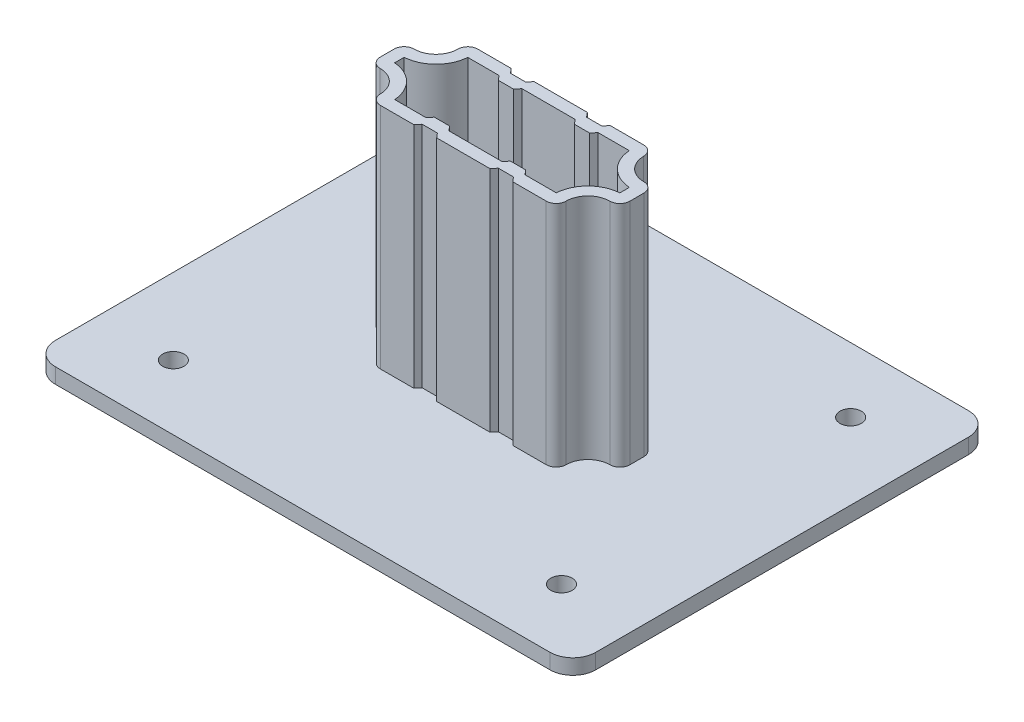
ISO-10303-21;
HEADER;
FILE_DESCRIPTION(('STEP AP214'),'2;1');
FILE_NAME('part.step','',(''),(''),'','','');
FILE_SCHEMA(('AUTOMOTIVE_DESIGN { 1 0 10303 214 1 1 1 1 }'));
ENDSEC;
DATA;
#1=APPLICATION_CONTEXT('core data for automotive mechanical design processes');
#2=APPLICATION_PROTOCOL_DEFINITION('international standard','automotive_design',2000,#1);
#3=PRODUCT_CONTEXT('',#1,'mechanical');
#4=PRODUCT('Part','Part','',(#3));
#5=PRODUCT_RELATED_PRODUCT_CATEGORY('part','',(#4));
#6=PRODUCT_DEFINITION_FORMATION('','',#4);
#7=PRODUCT_DEFINITION_CONTEXT('part definition',#1,'design');
#8=PRODUCT_DEFINITION('design','',#6,#7);
#9=PRODUCT_DEFINITION_SHAPE('','',#8);
#10=(LENGTH_UNIT() NAMED_UNIT(*) SI_UNIT(.MILLI.,.METRE.));
#11=(NAMED_UNIT(*) PLANE_ANGLE_UNIT() SI_UNIT($,.RADIAN.));
#12=(NAMED_UNIT(*) SI_UNIT($,.STERADIAN.) SOLID_ANGLE_UNIT());
#13=UNCERTAINTY_MEASURE_WITH_UNIT(LENGTH_MEASURE(1.E-05),#10,'distance_accuracy_value','');
#14=(GEOMETRIC_REPRESENTATION_CONTEXT(3) GLOBAL_UNCERTAINTY_ASSIGNED_CONTEXT((#13)) GLOBAL_UNIT_ASSIGNED_CONTEXT((#10,
#11,#12)) REPRESENTATION_CONTEXT('',''));
#15=CARTESIAN_POINT('',(0.,0.,0.));
#16=DIRECTION('',(0.,0.,1.));
#17=DIRECTION('',(1.,0.,0.));
#18=AXIS2_PLACEMENT_3D('',#15,#16,#17);
#19=CARTESIAN_POINT('',(0.,150.,-24.));
#20=DIRECTION('',(0.,0.,-1.));
#21=DIRECTION('',(-1.,0.,0.));
#22=AXIS2_PLACEMENT_3D('',#19,#20,#21);
#23=PLANE('',#22);
#24=DIRECTION('',(1.,0.,0.));
#25=VECTOR('',#24,1.);
#26=CARTESIAN_POINT('',(0.,0.,-24.));
#27=LINE('',#26,#25);
#28=CARTESIAN_POINT('',(32.5172988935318,0.,-24.));
#29=VERTEX_POINT('',#28);
#30=CARTESIAN_POINT('',(53.0500556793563,0.,-24.));
#31=VERTEX_POINT('',#30);
#32=EDGE_CURVE('E455',#29,#31,#27,.T.);
#33=ORIENTED_EDGE('',*,*,#32,.T.);
#34=DIRECTION('',(0.,-1.,0.));
#35=VECTOR('',#34,1.);
#36=CARTESIAN_POINT('',(53.0500556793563,150.,-24.));
#37=LINE('',#36,#35);
#38=CARTESIAN_POINT('',(53.0500556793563,150.,-24.));
#39=VERTEX_POINT('',#38);
#40=EDGE_CURVE('E540',#39,#31,#37,.T.);
#41=ORIENTED_EDGE('',*,*,#40,.F.);
#42=DIRECTION('',(1.,0.,0.));
#43=VECTOR('',#42,1.);
#44=CARTESIAN_POINT('',(0.,150.,-24.));
#45=LINE('',#44,#43);
#46=CARTESIAN_POINT('',(32.5172988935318,150.,-24.));
#47=VERTEX_POINT('',#46);
#48=EDGE_CURVE('E771',#47,#39,#45,.T.);
#49=ORIENTED_EDGE('',*,*,#48,.F.);
#50=DIRECTION('',(0.,-1.,0.));
#51=VECTOR('',#50,1.);
#52=CARTESIAN_POINT('',(32.5172988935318,150.,-24.));
#53=LINE('',#52,#51);
#54=EDGE_CURVE('E474',#47,#29,#53,.T.);
#55=ORIENTED_EDGE('',*,*,#54,.T.);
#56=EDGE_LOOP('',(#33,#41,#49,#55));
#57=FACE_BOUND('',#56,.T.);
#58=ADVANCED_FACE('F48',(#57),#23,.F.);
#59=CARTESIAN_POINT('',(75.5,150.,-25.5907508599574));
#60=DIRECTION('',(0.,-1.,0.));
#61=DIRECTION('',(0.,0.,-1.));
#62=AXIS2_PLACEMENT_3D('',#59,#60,#61);
#63=CYLINDRICAL_SURFACE('',#62,22.506232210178);
#64=CARTESIAN_POINT('',(75.5,0.,-25.5907508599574));
#65=DIRECTION('',(0.,1.,0.));
#66=DIRECTION('',(0.,0.,1.));
#67=AXIS2_PLACEMENT_3D('',#64,#65,#66);
#68=CIRCLE('',#67,22.506232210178);
#69=CARTESIAN_POINT('',(73.9995845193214,0.,-3.13458819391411));
#70=VERTEX_POINT('',#69);
#71=EDGE_CURVE('E911',#31,#70,#68,.T.);
#72=ORIENTED_EDGE('',*,*,#71,.T.);
#73=DIRECTION('',(0.,-1.,0.));
#74=VECTOR('',#73,1.);
#75=CARTESIAN_POINT('',(73.9995845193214,150.,-3.13458819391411));
#76=LINE('',#75,#74);
#77=CARTESIAN_POINT('',(73.9995845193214,150.,-3.13458819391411));
#78=VERTEX_POINT('',#77);
#79=EDGE_CURVE('E537',#78,#70,#76,.T.);
#80=ORIENTED_EDGE('',*,*,#79,.F.);
#81=CARTESIAN_POINT('',(75.5,150.,-25.5907508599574));
#82=DIRECTION('',(0.,1.,0.));
#83=DIRECTION('',(0.,0.,1.));
#84=AXIS2_PLACEMENT_3D('',#81,#82,#83);
#85=CIRCLE('',#84,22.506232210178);
#86=EDGE_CURVE('E774',#39,#78,#85,.T.);
#87=ORIENTED_EDGE('',*,*,#86,.F.);
#88=ORIENTED_EDGE('',*,*,#40,.T.);
#89=EDGE_LOOP('',(#72,#80,#87,#88));
#90=FACE_BOUND('',#89,.T.);
#91=ADVANCED_FACE('F1045',(#90),#63,.T.);
#92=CARTESIAN_POINT('',(73.9997917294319,150.,-0.00489937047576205));
#93=DIRECTION('',(-0.999999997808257,0.,6.6207895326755E-05));
#94=DIRECTION('',(6.6207895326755E-05,0.,0.999999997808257));
#95=AXIS2_PLACEMENT_3D('',#92,#93,#94);
#96=PLANE('',#95);
#97=DIRECTION('',(-6.6207895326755E-05,0.,-0.999999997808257));
#98=VECTOR('',#97,1.);
#99=CARTESIAN_POINT('',(73.9997917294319,0.,-0.00489937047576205));
#100=LINE('',#99,#98);
#101=CARTESIAN_POINT('',(74.,0.,3.14080653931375));
#102=VERTEX_POINT('',#101);
#103=EDGE_CURVE('E914',#102,#70,#100,.T.);
#104=ORIENTED_EDGE('',*,*,#103,.F.);
#105=DIRECTION('',(0.,-1.,0.));
#106=VECTOR('',#105,1.);
#107=CARTESIAN_POINT('',(74.,150.,3.14080653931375));
#108=LINE('',#107,#106);
#109=CARTESIAN_POINT('',(74.,150.,3.14080653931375));
#110=VERTEX_POINT('',#109);
#111=EDGE_CURVE('E534',#110,#102,#108,.T.);
#112=ORIENTED_EDGE('',*,*,#111,.F.);
#113=DIRECTION('',(-6.6207895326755E-05,0.,-0.999999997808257));
#114=VECTOR('',#113,1.);
#115=CARTESIAN_POINT('',(73.9997917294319,150.,-0.00489937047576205));
#116=LINE('',#115,#114);
#117=EDGE_CURVE('E776',#110,#78,#116,.T.);
#118=ORIENTED_EDGE('',*,*,#117,.T.);
#119=ORIENTED_EDGE('',*,*,#79,.T.);
#120=EDGE_LOOP('',(#104,#112,#118,#119));
#121=FACE_BOUND('',#120,.T.);
#122=ADVANCED_FACE('F1042',(#121),#96,.T.);
#123=CARTESIAN_POINT('',(75.5,150.,25.5907508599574));
#124=DIRECTION('',(0.,-1.,0.));
#125=DIRECTION('',(0.,0.,-1.));
#126=AXIS2_PLACEMENT_3D('',#123,#124,#125);
#127=CYLINDRICAL_SURFACE('',#126,22.5);
#128=CARTESIAN_POINT('',(75.5,0.,25.5907508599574));
#129=DIRECTION('',(0.,1.,0.));
#130=DIRECTION('',(0.,0.,1.));
#131=AXIS2_PLACEMENT_3D('',#128,#129,#130);
#132=CIRCLE('',#131,22.5);
#133=CARTESIAN_POINT('',(53.0563035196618,0.,23.9999999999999));
#134=VERTEX_POINT('',#133);
#135=EDGE_CURVE('E916',#102,#134,#132,.T.);
#136=ORIENTED_EDGE('',*,*,#135,.T.);
#137=DIRECTION('',(0.,-1.,0.));
#138=VECTOR('',#137,1.);
#139=CARTESIAN_POINT('',(53.0563035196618,150.,23.9999999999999));
#140=LINE('',#139,#138);
#141=CARTESIAN_POINT('',(53.0563035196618,150.,23.9999999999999));
#142=VERTEX_POINT('',#141);
#143=EDGE_CURVE('E531',#142,#134,#140,.T.);
#144=ORIENTED_EDGE('',*,*,#143,.F.);
#145=CARTESIAN_POINT('',(75.5,150.,25.5907508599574));
#146=DIRECTION('',(0.,1.,0.));
#147=DIRECTION('',(0.,0.,1.));
#148=AXIS2_PLACEMENT_3D('',#145,#146,#147);
#149=CIRCLE('',#148,22.5);
#150=EDGE_CURVE('E779',#110,#142,#149,.T.);
#151=ORIENTED_EDGE('',*,*,#150,.F.);
#152=ORIENTED_EDGE('',*,*,#111,.T.);
#153=EDGE_LOOP('',(#136,#144,#151,#152));
#154=FACE_BOUND('',#153,.T.);
#155=ADVANCED_FACE('F1038',(#154),#127,.T.);
#156=CARTESIAN_POINT('',(0.,150.,24.));
#157=DIRECTION('',(0.,0.,-1.));
#158=DIRECTION('',(-1.,0.,0.));
#159=AXIS2_PLACEMENT_3D('',#156,#157,#158);
#160=PLANE('',#159);
#161=DIRECTION('',(1.,0.,0.));
#162=VECTOR('',#161,1.);
#163=CARTESIAN_POINT('',(0.,0.,24.));
#164=LINE('',#163,#162);
#165=CARTESIAN_POINT('',(32.5172988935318,0.,24.));
#166=VERTEX_POINT('',#165);
#167=EDGE_CURVE('E919',#166,#134,#164,.T.);
#168=ORIENTED_EDGE('',*,*,#167,.F.);
#169=DIRECTION('',(0.,-1.,0.));
#170=VECTOR('',#169,1.);
#171=CARTESIAN_POINT('',(32.5172988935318,150.,24.));
#172=LINE('',#171,#170);
#173=CARTESIAN_POINT('',(32.5172988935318,150.,24.));
#174=VERTEX_POINT('',#173);
#175=EDGE_CURVE('E528',#174,#166,#172,.T.);
#176=ORIENTED_EDGE('',*,*,#175,.F.);
#177=DIRECTION('',(1.,0.,0.));
#178=VECTOR('',#177,1.);
#179=CARTESIAN_POINT('',(0.,150.,24.));
#180=LINE('',#179,#178);
#181=EDGE_CURVE('E781',#174,#142,#180,.T.);
#182=ORIENTED_EDGE('',*,*,#181,.T.);
#183=ORIENTED_EDGE('',*,*,#143,.T.);
#184=EDGE_LOOP('',(#168,#176,#182,#183));
#185=FACE_BOUND('',#184,.T.);
#186=ADVANCED_FACE('F1034',(#185),#160,.T.);
#187=CARTESIAN_POINT('',(7.26424125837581,150.,-6.09542216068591));
#188=DIRECTION('',(0.766044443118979,0.,-0.642787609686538));
#189=DIRECTION('',(-0.642787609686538,0.,-0.766044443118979));
#190=AXIS2_PLACEMENT_3D('',#187,#188,#189);
#191=PLANE('',#190);
#192=DIRECTION('',(0.642787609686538,0.,0.766044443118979));
#193=VECTOR('',#192,1.);
#194=CARTESIAN_POINT('',(7.26424125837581,0.,-6.09542216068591));
#195=LINE('',#194,#193);
#196=CARTESIAN_POINT('',(30.,0.,21.));
#197=VERTEX_POINT('',#196);
#198=EDGE_CURVE('E921',#197,#166,#195,.T.);
#199=ORIENTED_EDGE('',*,*,#198,.F.);
#200=DIRECTION('',(0.,-1.,0.));
#201=VECTOR('',#200,1.);
#202=CARTESIAN_POINT('',(30.,150.,21.));
#203=LINE('',#202,#201);
#204=CARTESIAN_POINT('',(30.,150.,21.));
#205=VERTEX_POINT('',#204);
#206=EDGE_CURVE('E525',#205,#197,#203,.T.);
#207=ORIENTED_EDGE('',*,*,#206,.F.);
#208=DIRECTION('',(0.642787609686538,0.,0.766044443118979));
#209=VECTOR('',#208,1.);
#210=CARTESIAN_POINT('',(7.26424125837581,150.,-6.09542216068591));
#211=LINE('',#210,#209);
#212=EDGE_CURVE('E784',#205,#174,#211,.T.);
#213=ORIENTED_EDGE('',*,*,#212,.T.);
#214=ORIENTED_EDGE('',*,*,#175,.T.);
#215=EDGE_LOOP('',(#199,#207,#213,#214));
#216=FACE_BOUND('',#215,.T.);
#217=ADVANCED_FACE('F1030',(#216),#191,.T.);
#218=CARTESIAN_POINT('',(0.,150.,21.));
#219=DIRECTION('',(0.,0.,-1.));
#220=DIRECTION('',(-1.,0.,0.));
#221=AXIS2_PLACEMENT_3D('',#218,#219,#220);
#222=PLANE('',#221);
#223=DIRECTION('',(1.,0.,0.));
#224=VECTOR('',#223,1.);
#225=CARTESIAN_POINT('',(0.,0.,21.));
#226=LINE('',#225,#224);
#227=CARTESIAN_POINT('',(20.,0.,21.));
#228=VERTEX_POINT('',#227);
#229=EDGE_CURVE('E923',#228,#197,#226,.T.);
#230=ORIENTED_EDGE('',*,*,#229,.F.);
#231=DIRECTION('',(0.,-1.,0.));
#232=VECTOR('',#231,1.);
#233=CARTESIAN_POINT('',(20.,150.,21.));
#234=LINE('',#233,#232);
#235=CARTESIAN_POINT('',(20.,150.,21.));
#236=VERTEX_POINT('',#235);
#237=EDGE_CURVE('E522',#236,#228,#234,.T.);
#238=ORIENTED_EDGE('',*,*,#237,.F.);
#239=DIRECTION('',(1.,0.,0.));
#240=VECTOR('',#239,1.);
#241=CARTESIAN_POINT('',(0.,150.,21.));
#242=LINE('',#241,#240);
#243=EDGE_CURVE('E787',#236,#205,#242,.T.);
#244=ORIENTED_EDGE('',*,*,#243,.T.);
#245=ORIENTED_EDGE('',*,*,#206,.T.);
#246=EDGE_LOOP('',(#230,#238,#244,#245));
#247=FACE_BOUND('',#246,.T.);
#248=ADVANCED_FACE('F1026',(#247),#222,.T.);
#249=CARTESIAN_POINT('',(22.0769631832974,150.,18.5247716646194));
#250=DIRECTION('',(0.766044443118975,0.,0.642787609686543));
#251=DIRECTION('',(0.642787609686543,0.,-0.766044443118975));
#252=AXIS2_PLACEMENT_3D('',#249,#250,#251);
#253=PLANE('',#252);
#254=DIRECTION('',(-0.642787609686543,0.,0.766044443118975));
#255=VECTOR('',#254,1.);
#256=CARTESIAN_POINT('',(22.0769631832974,0.,18.5247716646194));
#257=LINE('',#256,#255);
#258=CARTESIAN_POINT('',(17.4827011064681,0.,24.));
#259=VERTEX_POINT('',#258);
#260=EDGE_CURVE('E925',#228,#259,#257,.T.);
#261=ORIENTED_EDGE('',*,*,#260,.T.);
#262=DIRECTION('',(0.,-1.,0.));
#263=VECTOR('',#262,1.);
#264=CARTESIAN_POINT('',(17.4827011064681,150.,24.));
#265=LINE('',#264,#263);
#266=CARTESIAN_POINT('',(17.4827011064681,150.,24.));
#267=VERTEX_POINT('',#266);
#268=EDGE_CURVE('E519',#267,#259,#265,.T.);
#269=ORIENTED_EDGE('',*,*,#268,.F.);
#270=DIRECTION('',(-0.642787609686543,0.,0.766044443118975));
#271=VECTOR('',#270,1.);
#272=CARTESIAN_POINT('',(22.0769631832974,150.,18.5247716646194));
#273=LINE('',#272,#271);
#274=EDGE_CURVE('E790',#236,#267,#273,.T.);
#275=ORIENTED_EDGE('',*,*,#274,.F.);
#276=ORIENTED_EDGE('',*,*,#237,.T.);
#277=EDGE_LOOP('',(#261,#269,#275,#276));
#278=FACE_BOUND('',#277,.T.);
#279=ADVANCED_FACE('F1022',(#278),#253,.F.);
#280=CARTESIAN_POINT('',(0.,150.,24.));
#281=DIRECTION('',(0.,0.,-1.));
#282=DIRECTION('',(-1.,0.,0.));
#283=AXIS2_PLACEMENT_3D('',#280,#281,#282);
#284=PLANE('',#283);
#285=DIRECTION('',(1.,0.,0.));
#286=VECTOR('',#285,1.);
#287=CARTESIAN_POINT('',(0.,0.,24.));
#288=LINE('',#287,#286);
#289=CARTESIAN_POINT('',(-17.4827011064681,0.,24.));
#290=VERTEX_POINT('',#289);
#291=EDGE_CURVE('E928',#290,#259,#288,.T.);
#292=ORIENTED_EDGE('',*,*,#291,.F.);
#293=DIRECTION('',(0.,-1.,0.));
#294=VECTOR('',#293,1.);
#295=CARTESIAN_POINT('',(-17.4827011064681,150.,24.));
#296=LINE('',#295,#294);
#297=CARTESIAN_POINT('',(-17.4827011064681,150.,24.));
#298=VERTEX_POINT('',#297);
#299=EDGE_CURVE('E516',#298,#290,#296,.T.);
#300=ORIENTED_EDGE('',*,*,#299,.F.);
#301=DIRECTION('',(1.,0.,0.));
#302=VECTOR('',#301,1.);
#303=CARTESIAN_POINT('',(0.,150.,24.));
#304=LINE('',#303,#302);
#305=EDGE_CURVE('E792',#298,#267,#304,.T.);
#306=ORIENTED_EDGE('',*,*,#305,.T.);
#307=ORIENTED_EDGE('',*,*,#268,.T.);
#308=EDGE_LOOP('',(#292,#300,#306,#307));
#309=FACE_BOUND('',#308,.T.);
#310=ADVANCED_FACE('F1019',(#309),#284,.T.);
#311=CARTESIAN_POINT('',(-22.0769631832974,150.,18.5247716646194));
#312=DIRECTION('',(0.766044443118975,0.,-0.642787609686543));
#313=DIRECTION('',(-0.642787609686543,0.,-0.766044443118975));
#314=AXIS2_PLACEMENT_3D('',#311,#312,#313);
#315=PLANE('',#314);
#316=DIRECTION('',(0.642787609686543,0.,0.766044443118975));
#317=VECTOR('',#316,1.);
#318=CARTESIAN_POINT('',(-22.0769631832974,0.,18.5247716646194));
#319=LINE('',#318,#317);
#320=CARTESIAN_POINT('',(-20.,0.,21.));
#321=VERTEX_POINT('',#320);
#322=EDGE_CURVE('E930',#321,#290,#319,.T.);
#323=ORIENTED_EDGE('',*,*,#322,.F.);
#324=DIRECTION('',(0.,-1.,0.));
#325=VECTOR('',#324,1.);
#326=CARTESIAN_POINT('',(-20.,150.,21.));
#327=LINE('',#326,#325);
#328=CARTESIAN_POINT('',(-20.,150.,21.));
#329=VERTEX_POINT('',#328);
#330=EDGE_CURVE('E513',#329,#321,#327,.T.);
#331=ORIENTED_EDGE('',*,*,#330,.F.);
#332=DIRECTION('',(0.642787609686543,0.,0.766044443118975));
#333=VECTOR('',#332,1.);
#334=CARTESIAN_POINT('',(-22.0769631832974,150.,18.5247716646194));
#335=LINE('',#334,#333);
#336=EDGE_CURVE('E795',#329,#298,#335,.T.);
#337=ORIENTED_EDGE('',*,*,#336,.T.);
#338=ORIENTED_EDGE('',*,*,#299,.T.);
#339=EDGE_LOOP('',(#323,#331,#337,#338));
#340=FACE_BOUND('',#339,.T.);
#341=ADVANCED_FACE('F1015',(#340),#315,.T.);
#342=CARTESIAN_POINT('',(0.,150.,21.));
#343=DIRECTION('',(0.,0.,1.));
#344=DIRECTION('',(1.,0.,0.));
#345=AXIS2_PLACEMENT_3D('',#342,#343,#344);
#346=PLANE('',#345);
#347=DIRECTION('',(-1.,0.,0.));
#348=VECTOR('',#347,1.);
#349=CARTESIAN_POINT('',(0.,0.,21.));
#350=LINE('',#349,#348);
#351=CARTESIAN_POINT('',(-30.,0.,21.));
#352=VERTEX_POINT('',#351);
#353=EDGE_CURVE('E932',#321,#352,#350,.T.);
#354=ORIENTED_EDGE('',*,*,#353,.T.);
#355=DIRECTION('',(0.,-1.,0.));
#356=VECTOR('',#355,1.);
#357=CARTESIAN_POINT('',(-30.,150.,21.));
#358=LINE('',#357,#356);
#359=CARTESIAN_POINT('',(-30.,150.,21.));
#360=VERTEX_POINT('',#359);
#361=EDGE_CURVE('E510',#360,#352,#358,.T.);
#362=ORIENTED_EDGE('',*,*,#361,.F.);
#363=DIRECTION('',(-1.,0.,0.));
#364=VECTOR('',#363,1.);
#365=CARTESIAN_POINT('',(0.,150.,21.));
#366=LINE('',#365,#364);
#367=EDGE_CURVE('E798',#329,#360,#366,.T.);
#368=ORIENTED_EDGE('',*,*,#367,.F.);
#369=ORIENTED_EDGE('',*,*,#330,.T.);
#370=EDGE_LOOP('',(#354,#362,#368,#369));
#371=FACE_BOUND('',#370,.T.);
#372=ADVANCED_FACE('F1005',(#371),#346,.F.);
#373=CARTESIAN_POINT('',(-7.26424125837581,150.,-6.09542216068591));
#374=DIRECTION('',(0.766044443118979,0.,0.642787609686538));
#375=DIRECTION('',(0.642787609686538,0.,-0.766044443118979));
#376=AXIS2_PLACEMENT_3D('',#373,#374,#375);
#377=PLANE('',#376);
#378=DIRECTION('',(-0.642787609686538,0.,0.766044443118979));
#379=VECTOR('',#378,1.);
#380=CARTESIAN_POINT('',(-7.26424125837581,0.,-6.09542216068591));
#381=LINE('',#380,#379);
#382=CARTESIAN_POINT('',(-32.5172988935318,0.,24.));
#383=VERTEX_POINT('',#382);
#384=EDGE_CURVE('E935',#352,#383,#381,.T.);
#385=ORIENTED_EDGE('',*,*,#384,.T.);
#386=DIRECTION('',(0.,-1.,0.));
#387=VECTOR('',#386,1.);
#388=CARTESIAN_POINT('',(-32.5172988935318,150.,24.));
#389=LINE('',#388,#387);
#390=CARTESIAN_POINT('',(-32.5172988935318,150.,24.));
#391=VERTEX_POINT('',#390);
#392=EDGE_CURVE('E507',#391,#383,#389,.T.);
#393=ORIENTED_EDGE('',*,*,#392,.F.);
#394=DIRECTION('',(-0.642787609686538,0.,0.766044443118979));
#395=VECTOR('',#394,1.);
#396=CARTESIAN_POINT('',(-7.26424125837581,150.,-6.09542216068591));
#397=LINE('',#396,#395);
#398=EDGE_CURVE('E800',#360,#391,#397,.T.);
#399=ORIENTED_EDGE('',*,*,#398,.F.);
#400=ORIENTED_EDGE('',*,*,#361,.T.);
#401=EDGE_LOOP('',(#385,#393,#399,#400));
#402=FACE_BOUND('',#401,.T.);
#403=ADVANCED_FACE('F1009',(#402),#377,.F.);
#404=CARTESIAN_POINT('',(0.,150.,24.));
#405=DIRECTION('',(0.,0.,-1.));
#406=DIRECTION('',(-1.,0.,0.));
#407=AXIS2_PLACEMENT_3D('',#404,#405,#406);
#408=PLANE('',#407);
#409=DIRECTION('',(1.,0.,0.));
#410=VECTOR('',#409,1.);
#411=CARTESIAN_POINT('',(0.,0.,24.));
#412=LINE('',#411,#410);
#413=CARTESIAN_POINT('',(-53.0563035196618,0.,24.));
#414=VERTEX_POINT('',#413);
#415=EDGE_CURVE('E938',#414,#383,#412,.T.);
#416=ORIENTED_EDGE('',*,*,#415,.F.);
#417=DIRECTION('',(0.,-1.,0.));
#418=VECTOR('',#417,1.);
#419=CARTESIAN_POINT('',(-53.0563035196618,150.,24.));
#420=LINE('',#419,#418);
#421=CARTESIAN_POINT('',(-53.0563035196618,150.,24.));
#422=VERTEX_POINT('',#421);
#423=EDGE_CURVE('E504',#422,#414,#420,.T.);
#424=ORIENTED_EDGE('',*,*,#423,.F.);
#425=DIRECTION('',(1.,0.,0.));
#426=VECTOR('',#425,1.);
#427=CARTESIAN_POINT('',(0.,150.,24.));
#428=LINE('',#427,#426);
#429=EDGE_CURVE('E802',#422,#391,#428,.T.);
#430=ORIENTED_EDGE('',*,*,#429,.T.);
#431=ORIENTED_EDGE('',*,*,#392,.T.);
#432=EDGE_LOOP('',(#416,#424,#430,#431));
#433=FACE_BOUND('',#432,.T.);
#434=ADVANCED_FACE('F1000',(#433),#408,.T.);
#435=CARTESIAN_POINT('',(-75.5,150.,25.5907508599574));
#436=DIRECTION('',(0.,-1.,0.));
#437=DIRECTION('',(0.,0.,-1.));
#438=AXIS2_PLACEMENT_3D('',#435,#436,#437);
#439=CYLINDRICAL_SURFACE('',#438,22.5);
#440=CARTESIAN_POINT('',(-75.5,0.,25.5907508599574));
#441=DIRECTION('',(0.,1.,0.));
#442=DIRECTION('',(0.,0.,1.));
#443=AXIS2_PLACEMENT_3D('',#440,#441,#442);
#444=CIRCLE('',#443,22.5);
#445=CARTESIAN_POINT('',(-73.9999999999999,0.,3.14080653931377));
#446=VERTEX_POINT('',#445);
#447=EDGE_CURVE('E940',#414,#446,#444,.T.);
#448=ORIENTED_EDGE('',*,*,#447,.T.);
#449=DIRECTION('',(0.,-1.,0.));
#450=VECTOR('',#449,1.);
#451=CARTESIAN_POINT('',(-73.9999999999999,150.,3.14080653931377));
#452=LINE('',#451,#450);
#453=CARTESIAN_POINT('',(-73.9999999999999,150.,3.14080653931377));
#454=VERTEX_POINT('',#453);
#455=EDGE_CURVE('E501',#454,#446,#452,.T.);
#456=ORIENTED_EDGE('',*,*,#455,.F.);
#457=CARTESIAN_POINT('',(-75.5,150.,25.5907508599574));
#458=DIRECTION('',(0.,1.,0.));
#459=DIRECTION('',(0.,0.,1.));
#460=AXIS2_PLACEMENT_3D('',#457,#458,#459);
#461=CIRCLE('',#460,22.5);
#462=EDGE_CURVE('E805',#422,#454,#461,.T.);
#463=ORIENTED_EDGE('',*,*,#462,.F.);
#464=ORIENTED_EDGE('',*,*,#423,.T.);
#465=EDGE_LOOP('',(#448,#456,#463,#464));
#466=FACE_BOUND('',#465,.T.);
#467=ADVANCED_FACE('F995',(#466),#439,.T.);
#468=CARTESIAN_POINT('',(-73.9999999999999,150.,0.));
#469=DIRECTION('',(-1.,0.,0.));
#470=DIRECTION('',(0.,0.,1.));
#471=AXIS2_PLACEMENT_3D('',#468,#469,#470);
#472=PLANE('',#471);
#473=DIRECTION('',(0.,0.,-1.));
#474=VECTOR('',#473,1.);
#475=CARTESIAN_POINT('',(-73.9999999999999,0.,0.));
#476=LINE('',#475,#474);
#477=CARTESIAN_POINT('',(-73.9999999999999,0.,-3.14080653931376));
#478=VERTEX_POINT('',#477);
#479=EDGE_CURVE('E943',#446,#478,#476,.T.);
#480=ORIENTED_EDGE('',*,*,#479,.T.);
#481=DIRECTION('',(0.,-1.,0.));
#482=VECTOR('',#481,1.);
#483=CARTESIAN_POINT('',(-73.9999999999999,150.,-3.14080653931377));
#484=LINE('',#483,#482);
#485=CARTESIAN_POINT('',(-73.9999999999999,150.,-3.14080653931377));
#486=VERTEX_POINT('',#485);
#487=EDGE_CURVE('E498',#486,#478,#484,.T.);
#488=ORIENTED_EDGE('',*,*,#487,.F.);
#489=DIRECTION('',(0.,0.,-1.));
#490=VECTOR('',#489,1.);
#491=CARTESIAN_POINT('',(-73.9999999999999,150.,0.));
#492=LINE('',#491,#490);
#493=EDGE_CURVE('E807',#454,#486,#492,.T.);
#494=ORIENTED_EDGE('',*,*,#493,.F.);
#495=ORIENTED_EDGE('',*,*,#455,.T.);
#496=EDGE_LOOP('',(#480,#488,#494,#495));
#497=FACE_BOUND('',#496,.T.);
#498=ADVANCED_FACE('F992',(#497),#472,.F.);
#499=CARTESIAN_POINT('',(-75.5,150.,-25.5907508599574));
#500=DIRECTION('',(0.,-1.,0.));
#501=DIRECTION('',(0.,0.,-1.));
#502=AXIS2_PLACEMENT_3D('',#499,#500,#501);
#503=CYLINDRICAL_SURFACE('',#502,22.5);
#504=CARTESIAN_POINT('',(-75.5,0.,-25.5907508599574));
#505=DIRECTION('',(0.,1.,0.));
#506=DIRECTION('',(0.,0.,1.));
#507=AXIS2_PLACEMENT_3D('',#504,#505,#506);
#508=CIRCLE('',#507,22.5);
#509=CARTESIAN_POINT('',(-53.0563035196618,0.,-24.));
#510=VERTEX_POINT('',#509);
#511=EDGE_CURVE('E946',#478,#510,#508,.T.);
#512=ORIENTED_EDGE('',*,*,#511,.T.);
#513=DIRECTION('',(0.,-1.,0.));
#514=VECTOR('',#513,1.);
#515=CARTESIAN_POINT('',(-53.0563035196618,150.,-24.));
#516=LINE('',#515,#514);
#517=CARTESIAN_POINT('',(-53.0563035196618,150.,-24.));
#518=VERTEX_POINT('',#517);
#519=EDGE_CURVE('E495',#518,#510,#516,.T.);
#520=ORIENTED_EDGE('',*,*,#519,.F.);
#521=CARTESIAN_POINT('',(-75.5,150.,-25.5907508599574));
#522=DIRECTION('',(0.,1.,0.));
#523=DIRECTION('',(0.,0.,1.));
#524=AXIS2_PLACEMENT_3D('',#521,#522,#523);
#525=CIRCLE('',#524,22.5);
#526=EDGE_CURVE('E809',#486,#518,#525,.T.);
#527=ORIENTED_EDGE('',*,*,#526,.F.);
#528=ORIENTED_EDGE('',*,*,#487,.T.);
#529=EDGE_LOOP('',(#512,#520,#527,#528));
#530=FACE_BOUND('',#529,.T.);
#531=ADVANCED_FACE('F987',(#530),#503,.T.);
#532=CARTESIAN_POINT('',(0.,150.,-24.));
#533=DIRECTION('',(0.,0.,-1.));
#534=DIRECTION('',(-1.,0.,0.));
#535=AXIS2_PLACEMENT_3D('',#532,#533,#534);
#536=PLANE('',#535);
#537=DIRECTION('',(1.,0.,0.));
#538=VECTOR('',#537,1.);
#539=CARTESIAN_POINT('',(0.,0.,-24.));
#540=LINE('',#539,#538);
#541=CARTESIAN_POINT('',(-32.5172988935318,0.,-24.));
#542=VERTEX_POINT('',#541);
#543=EDGE_CURVE('E949',#510,#542,#540,.T.);
#544=ORIENTED_EDGE('',*,*,#543,.T.);
#545=DIRECTION('',(0.,-1.,0.));
#546=VECTOR('',#545,1.);
#547=CARTESIAN_POINT('',(-32.5172988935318,150.,-24.));
#548=LINE('',#547,#546);
#549=CARTESIAN_POINT('',(-32.5172988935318,150.,-24.));
#550=VERTEX_POINT('',#549);
#551=EDGE_CURVE('E492',#550,#542,#548,.T.);
#552=ORIENTED_EDGE('',*,*,#551,.F.);
#553=DIRECTION('',(1.,0.,0.));
#554=VECTOR('',#553,1.);
#555=CARTESIAN_POINT('',(0.,150.,-24.));
#556=LINE('',#555,#554);
#557=EDGE_CURVE('E811',#518,#550,#556,.T.);
#558=ORIENTED_EDGE('',*,*,#557,.F.);
#559=ORIENTED_EDGE('',*,*,#519,.T.);
#560=EDGE_LOOP('',(#544,#552,#558,#559));
#561=FACE_BOUND('',#560,.T.);
#562=ADVANCED_FACE('F984',(#561),#536,.F.);
#563=CARTESIAN_POINT('',(-7.26424125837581,150.,6.09542216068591));
#564=DIRECTION('',(-0.766044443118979,0.,0.642787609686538));
#565=DIRECTION('',(0.642787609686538,0.,0.766044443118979));
#566=AXIS2_PLACEMENT_3D('',#563,#564,#565);
#567=PLANE('',#566);
#568=DIRECTION('',(-0.642787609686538,0.,-0.766044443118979));
#569=VECTOR('',#568,1.);
#570=CARTESIAN_POINT('',(-7.26424125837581,0.,6.09542216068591));
#571=LINE('',#570,#569);
#572=CARTESIAN_POINT('',(-30.,0.,-21.));
#573=VERTEX_POINT('',#572);
#574=EDGE_CURVE('E952',#573,#542,#571,.T.);
#575=ORIENTED_EDGE('',*,*,#574,.F.);
#576=DIRECTION('',(0.,-1.,0.));
#577=VECTOR('',#576,1.);
#578=CARTESIAN_POINT('',(-30.,150.,-21.));
#579=LINE('',#578,#577);
#580=CARTESIAN_POINT('',(-30.,150.,-21.));
#581=VERTEX_POINT('',#580);
#582=EDGE_CURVE('E489',#581,#573,#579,.T.);
#583=ORIENTED_EDGE('',*,*,#582,.F.);
#584=DIRECTION('',(-0.642787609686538,0.,-0.766044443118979));
#585=VECTOR('',#584,1.);
#586=CARTESIAN_POINT('',(-7.26424125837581,150.,6.09542216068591));
#587=LINE('',#586,#585);
#588=EDGE_CURVE('E813',#581,#550,#587,.T.);
#589=ORIENTED_EDGE('',*,*,#588,.T.);
#590=ORIENTED_EDGE('',*,*,#551,.T.);
#591=EDGE_LOOP('',(#575,#583,#589,#590));
#592=FACE_BOUND('',#591,.T.);
#593=ADVANCED_FACE('F980',(#592),#567,.T.);
#594=CARTESIAN_POINT('',(0.,150.,-21.));
#595=DIRECTION('',(0.,0.,1.));
#596=DIRECTION('',(1.,0.,0.));
#597=AXIS2_PLACEMENT_3D('',#594,#595,#596);
#598=PLANE('',#597);
#599=DIRECTION('',(-1.,0.,0.));
#600=VECTOR('',#599,1.);
#601=CARTESIAN_POINT('',(0.,0.,-21.));
#602=LINE('',#601,#600);
#603=CARTESIAN_POINT('',(-20.,0.,-21.));
#604=VERTEX_POINT('',#603);
#605=EDGE_CURVE('E954',#604,#573,#602,.T.);
#606=ORIENTED_EDGE('',*,*,#605,.F.);
#607=DIRECTION('',(0.,-1.,0.));
#608=VECTOR('',#607,1.);
#609=CARTESIAN_POINT('',(-20.,150.,-21.));
#610=LINE('',#609,#608);
#611=CARTESIAN_POINT('',(-20.,150.,-21.));
#612=VERTEX_POINT('',#611);
#613=EDGE_CURVE('E486',#612,#604,#610,.T.);
#614=ORIENTED_EDGE('',*,*,#613,.F.);
#615=DIRECTION('',(-1.,0.,0.));
#616=VECTOR('',#615,1.);
#617=CARTESIAN_POINT('',(0.,150.,-21.));
#618=LINE('',#617,#616);
#619=EDGE_CURVE('E816',#612,#581,#618,.T.);
#620=ORIENTED_EDGE('',*,*,#619,.T.);
#621=ORIENTED_EDGE('',*,*,#582,.T.);
#622=EDGE_LOOP('',(#606,#614,#620,#621));
#623=FACE_BOUND('',#622,.T.);
#624=ADVANCED_FACE('F977',(#623),#598,.T.);
#625=CARTESIAN_POINT('',(-22.0769631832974,150.,-18.5247716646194));
#626=DIRECTION('',(-0.766044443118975,0.,-0.642787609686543));
#627=DIRECTION('',(-0.642787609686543,0.,0.766044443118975));
#628=AXIS2_PLACEMENT_3D('',#625,#626,#627);
#629=PLANE('',#628);
#630=DIRECTION('',(0.642787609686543,0.,-0.766044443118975));
#631=VECTOR('',#630,1.);
#632=CARTESIAN_POINT('',(-22.0769631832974,0.,-18.5247716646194));
#633=LINE('',#632,#631);
#634=CARTESIAN_POINT('',(-17.4827011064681,0.,-24.));
#635=VERTEX_POINT('',#634);
#636=EDGE_CURVE('E956',#604,#635,#633,.T.);
#637=ORIENTED_EDGE('',*,*,#636,.T.);
#638=DIRECTION('',(0.,-1.,0.));
#639=VECTOR('',#638,1.);
#640=CARTESIAN_POINT('',(-17.4827011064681,150.,-24.));
#641=LINE('',#640,#639);
#642=CARTESIAN_POINT('',(-17.4827011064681,150.,-24.));
#643=VERTEX_POINT('',#642);
#644=EDGE_CURVE('E483',#643,#635,#641,.T.);
#645=ORIENTED_EDGE('',*,*,#644,.F.);
#646=DIRECTION('',(0.642787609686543,0.,-0.766044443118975));
#647=VECTOR('',#646,1.);
#648=CARTESIAN_POINT('',(-22.0769631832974,150.,-18.5247716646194));
#649=LINE('',#648,#647);
#650=EDGE_CURVE('E819',#612,#643,#649,.T.);
#651=ORIENTED_EDGE('',*,*,#650,.F.);
#652=ORIENTED_EDGE('',*,*,#613,.T.);
#653=EDGE_LOOP('',(#637,#645,#651,#652));
#654=FACE_BOUND('',#653,.T.);
#655=ADVANCED_FACE('F972',(#654),#629,.F.);
#656=CARTESIAN_POINT('',(0.,150.,-24.));
#657=DIRECTION('',(0.,0.,-1.));
#658=DIRECTION('',(-1.,0.,0.));
#659=AXIS2_PLACEMENT_3D('',#656,#657,#658);
#660=PLANE('',#659);
#661=DIRECTION('',(1.,0.,0.));
#662=VECTOR('',#661,1.);
#663=CARTESIAN_POINT('',(0.,0.,-24.));
#664=LINE('',#663,#662);
#665=CARTESIAN_POINT('',(17.4827011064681,0.,-24.));
#666=VERTEX_POINT('',#665);
#667=EDGE_CURVE('E959',#635,#666,#664,.T.);
#668=ORIENTED_EDGE('',*,*,#667,.T.);
#669=DIRECTION('',(0.,-1.,0.));
#670=VECTOR('',#669,1.);
#671=CARTESIAN_POINT('',(17.4827011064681,150.,-24.));
#672=LINE('',#671,#670);
#673=CARTESIAN_POINT('',(17.4827011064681,150.,-24.));
#674=VERTEX_POINT('',#673);
#675=EDGE_CURVE('E476',#674,#666,#672,.T.);
#676=ORIENTED_EDGE('',*,*,#675,.F.);
#677=DIRECTION('',(1.,0.,0.));
#678=VECTOR('',#677,1.);
#679=CARTESIAN_POINT('',(0.,150.,-24.));
#680=LINE('',#679,#678);
#681=EDGE_CURVE('E821',#643,#674,#680,.T.);
#682=ORIENTED_EDGE('',*,*,#681,.F.);
#683=ORIENTED_EDGE('',*,*,#644,.T.);
#684=EDGE_LOOP('',(#668,#676,#682,#683));
#685=FACE_BOUND('',#684,.T.);
#686=ADVANCED_FACE('F968',(#685),#660,.F.);
#687=CARTESIAN_POINT('',(22.0769631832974,150.,-18.5247716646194));
#688=DIRECTION('',(-0.766044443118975,0.,0.642787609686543));
#689=DIRECTION('',(0.642787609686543,0.,0.766044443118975));
#690=AXIS2_PLACEMENT_3D('',#687,#688,#689);
#691=PLANE('',#690);
#692=DIRECTION('',(-0.642787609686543,0.,-0.766044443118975));
#693=VECTOR('',#692,1.);
#694=CARTESIAN_POINT('',(22.0769631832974,0.,-18.5247716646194));
#695=LINE('',#694,#693);
#696=CARTESIAN_POINT('',(20.,0.,-21.));
#697=VERTEX_POINT('',#696);
#698=EDGE_CURVE('E470',#697,#666,#695,.T.);
#699=ORIENTED_EDGE('',*,*,#698,.F.);
#700=DIRECTION('',(0.,-1.,0.));
#701=VECTOR('',#700,1.);
#702=CARTESIAN_POINT('',(20.,150.,-21.));
#703=LINE('',#702,#701);
#704=CARTESIAN_POINT('',(20.,150.,-21.));
#705=VERTEX_POINT('',#704);
#706=EDGE_CURVE('E468',#705,#697,#703,.T.);
#707=ORIENTED_EDGE('',*,*,#706,.F.);
#708=DIRECTION('',(-0.642787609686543,0.,-0.766044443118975));
#709=VECTOR('',#708,1.);
#710=CARTESIAN_POINT('',(22.0769631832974,150.,-18.5247716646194));
#711=LINE('',#710,#709);
#712=EDGE_CURVE('E823',#705,#674,#711,.T.);
#713=ORIENTED_EDGE('',*,*,#712,.T.);
#714=ORIENTED_EDGE('',*,*,#675,.T.);
#715=EDGE_LOOP('',(#699,#707,#713,#714));
#716=FACE_BOUND('',#715,.T.);
#717=ADVANCED_FACE('F964',(#716),#691,.T.);
#718=CARTESIAN_POINT('',(0.,150.,-21.));
#719=DIRECTION('',(0.,0.,-1.));
#720=DIRECTION('',(-1.,0.,0.));
#721=AXIS2_PLACEMENT_3D('',#718,#719,#720);
#722=PLANE('',#721);
#723=DIRECTION('',(1.,0.,0.));
#724=VECTOR('',#723,1.);
#725=CARTESIAN_POINT('',(0.,0.,-21.));
#726=LINE('',#725,#724);
#727=CARTESIAN_POINT('',(30.,0.,-21.));
#728=VERTEX_POINT('',#727);
#729=EDGE_CURVE('E452',#697,#728,#726,.T.);
#730=ORIENTED_EDGE('',*,*,#729,.T.);
#731=DIRECTION('',(0.,-1.,0.));
#732=VECTOR('',#731,1.);
#733=CARTESIAN_POINT('',(30.,150.,-21.));
#734=LINE('',#733,#732);
#735=CARTESIAN_POINT('',(30.,150.,-21.));
#736=VERTEX_POINT('',#735);
#737=EDGE_CURVE('E466',#736,#728,#734,.T.);
#738=ORIENTED_EDGE('',*,*,#737,.F.);
#739=DIRECTION('',(1.,0.,0.));
#740=VECTOR('',#739,1.);
#741=CARTESIAN_POINT('',(0.,150.,-21.));
#742=LINE('',#741,#740);
#743=EDGE_CURVE('E826',#705,#736,#742,.T.);
#744=ORIENTED_EDGE('',*,*,#743,.F.);
#745=ORIENTED_EDGE('',*,*,#706,.T.);
#746=EDGE_LOOP('',(#730,#738,#744,#745));
#747=FACE_BOUND('',#746,.T.);
#748=ADVANCED_FACE('F464',(#747),#722,.F.);
#749=CARTESIAN_POINT('',(-54.5,150.,-25.5));
#750=DIRECTION('',(0.,-1.,0.));
#751=DIRECTION('',(0.,0.,-1.));
#752=AXIS2_PLACEMENT_3D('',#749,#750,#751);
#753=CYLINDRICAL_SURFACE('',#752,6.5);
#754=CARTESIAN_POINT('',(-54.5,0.,-25.5));
#755=DIRECTION('',(0.,1.,0.));
#756=DIRECTION('',(0.,0.,1.));
#757=AXIS2_PLACEMENT_3D('',#754,#755,#756);
#758=CIRCLE('',#757,6.5);
#759=CARTESIAN_POINT('',(-61.,0.,-25.5));
#760=VERTEX_POINT('',#759);
#761=CARTESIAN_POINT('',(-54.5,0.,-32.));
#762=VERTEX_POINT('',#761);
#763=EDGE_CURVE('E829',#760,#762,#758,.F.);
#764=ORIENTED_EDGE('',*,*,#763,.F.);
#765=DIRECTION('',(0.,-1.,0.));
#766=VECTOR('',#765,1.);
#767=CARTESIAN_POINT('',(-61.,150.,-25.5));
#768=LINE('',#767,#766);
#769=CARTESIAN_POINT('',(-61.,150.,-25.5));
#770=VERTEX_POINT('',#769);
#771=EDGE_CURVE('E478',#770,#760,#768,.T.);
#772=ORIENTED_EDGE('',*,*,#771,.F.);
#773=CARTESIAN_POINT('',(-54.5,150.,-25.5));
#774=DIRECTION('',(0.,1.,0.));
#775=DIRECTION('',(0.,0.,1.));
#776=AXIS2_PLACEMENT_3D('',#773,#774,#775);
#777=CIRCLE('',#776,6.5);
#778=CARTESIAN_POINT('',(-54.5,150.,-32.));
#779=VERTEX_POINT('',#778);
#780=EDGE_CURVE('E460',#770,#779,#777,.F.);
#781=ORIENTED_EDGE('',*,*,#780,.T.);
#782=DIRECTION('',(0.,-1.,0.));
#783=VECTOR('',#782,1.);
#784=CARTESIAN_POINT('',(-54.5,150.,-32.));
#785=LINE('',#784,#783);
#786=EDGE_CURVE('E544',#779,#762,#785,.T.);
#787=ORIENTED_EDGE('',*,*,#786,.T.);
#788=EDGE_LOOP('',(#764,#772,#781,#787));
#789=FACE_BOUND('',#788,.T.);
#790=ADVANCED_FACE('F1180',(#789),#753,.T.);
#791=CARTESIAN_POINT('',(-75.5,150.,-25.5907508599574));
#792=DIRECTION('',(0.,-1.,0.));
#793=DIRECTION('',(0.,0.,-1.));
#794=AXIS2_PLACEMENT_3D('',#791,#792,#793);
#795=CYLINDRICAL_SURFACE('',#794,14.500283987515);
#796=CARTESIAN_POINT('',(-75.5,0.,-25.5907508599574));
#797=DIRECTION('',(0.,1.,0.));
#798=DIRECTION('',(0.,0.,1.));
#799=AXIS2_PLACEMENT_3D('',#796,#797,#798);
#800=CIRCLE('',#799,14.500283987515);
#801=CARTESIAN_POINT('',(-75.5,0.,-11.0904668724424));
#802=VERTEX_POINT('',#801);
#803=EDGE_CURVE('E831',#760,#802,#800,.F.);
#804=ORIENTED_EDGE('',*,*,#803,.T.);
#805=DIRECTION('',(0.,-1.,0.));
#806=VECTOR('',#805,1.);
#807=CARTESIAN_POINT('',(-75.5,150.,-11.0904668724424));
#808=LINE('',#807,#806);
#809=CARTESIAN_POINT('',(-75.5,150.,-11.0904668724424));
#810=VERTEX_POINT('',#809);
#811=EDGE_CURVE('E634',#810,#802,#808,.T.);
#812=ORIENTED_EDGE('',*,*,#811,.F.);
#813=CARTESIAN_POINT('',(-75.5,150.,-25.5907508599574));
#814=DIRECTION('',(0.,1.,0.));
#815=DIRECTION('',(0.,0.,1.));
#816=AXIS2_PLACEMENT_3D('',#813,#814,#815);
#817=CIRCLE('',#816,14.500283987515);
#818=EDGE_CURVE('E694',#770,#810,#817,.F.);
#819=ORIENTED_EDGE('',*,*,#818,.F.);
#820=ORIENTED_EDGE('',*,*,#771,.T.);
#821=EDGE_LOOP('',(#804,#812,#819,#820));
#822=FACE_BOUND('',#821,.T.);
#823=ADVANCED_FACE('F1176',(#822),#795,.F.);
#824=CARTESIAN_POINT('',(-75.5,150.,-4.59046687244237));
#825=DIRECTION('',(0.,-1.,0.));
#826=DIRECTION('',(0.,0.,-1.));
#827=AXIS2_PLACEMENT_3D('',#824,#825,#826);
#828=CYLINDRICAL_SURFACE('',#827,6.5);
#829=CARTESIAN_POINT('',(-75.5,0.,-4.59046687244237));
#830=DIRECTION('',(0.,1.,0.));
#831=DIRECTION('',(0.,0.,1.));
#832=AXIS2_PLACEMENT_3D('',#829,#830,#831);
#833=CIRCLE('',#832,6.5);
#834=CARTESIAN_POINT('',(-82.,0.,-4.59046687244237));
#835=VERTEX_POINT('',#834);
#836=EDGE_CURVE('E835',#835,#802,#833,.F.);
#837=ORIENTED_EDGE('',*,*,#836,.F.);
#838=DIRECTION('',(0.,-1.,0.));
#839=VECTOR('',#838,1.);
#840=CARTESIAN_POINT('',(-82.,150.,-4.59046687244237));
#841=LINE('',#840,#839);
#842=CARTESIAN_POINT('',(-82.,150.,-4.59046687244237));
#843=VERTEX_POINT('',#842);
#844=EDGE_CURVE('E631',#843,#835,#841,.T.);
#845=ORIENTED_EDGE('',*,*,#844,.F.);
#846=CARTESIAN_POINT('',(-75.5,150.,-4.59046687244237));
#847=DIRECTION('',(0.,1.,0.));
#848=DIRECTION('',(0.,0.,1.));
#849=AXIS2_PLACEMENT_3D('',#846,#847,#848);
#850=CIRCLE('',#849,6.5);
#851=EDGE_CURVE('E696',#843,#810,#850,.F.);
#852=ORIENTED_EDGE('',*,*,#851,.T.);
#853=ORIENTED_EDGE('',*,*,#811,.T.);
#854=EDGE_LOOP('',(#837,#845,#852,#853));
#855=FACE_BOUND('',#854,.T.);
#856=ADVANCED_FACE('F1172',(#855),#828,.T.);
#857=CARTESIAN_POINT('',(-82.,150.,0.));
#858=DIRECTION('',(1.,0.,0.));
#859=DIRECTION('',(0.,0.,-1.));
#860=AXIS2_PLACEMENT_3D('',#857,#858,#859);
#861=PLANE('',#860);
#862=DIRECTION('',(0.,0.,1.));
#863=VECTOR('',#862,1.);
#864=CARTESIAN_POINT('',(-82.,0.,0.));
#865=LINE('',#864,#863);
#866=CARTESIAN_POINT('',(-82.,0.,4.59046687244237));
#867=VERTEX_POINT('',#866);
#868=EDGE_CURVE('E837',#835,#867,#865,.T.);
#869=ORIENTED_EDGE('',*,*,#868,.T.);
#870=DIRECTION('',(0.,-1.,0.));
#871=VECTOR('',#870,1.);
#872=CARTESIAN_POINT('',(-82.,150.,4.59046687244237));
#873=LINE('',#872,#871);
#874=CARTESIAN_POINT('',(-82.,150.,4.59046687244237));
#875=VERTEX_POINT('',#874);
#876=EDGE_CURVE('E628',#875,#867,#873,.T.);
#877=ORIENTED_EDGE('',*,*,#876,.F.);
#878=DIRECTION('',(0.,0.,1.));
#879=VECTOR('',#878,1.);
#880=CARTESIAN_POINT('',(-82.,150.,0.));
#881=LINE('',#880,#879);
#882=EDGE_CURVE('E699',#843,#875,#881,.T.);
#883=ORIENTED_EDGE('',*,*,#882,.F.);
#884=ORIENTED_EDGE('',*,*,#844,.T.);
#885=EDGE_LOOP('',(#869,#877,#883,#884));
#886=FACE_BOUND('',#885,.T.);
#887=ADVANCED_FACE('F1168',(#886),#861,.F.);
#888=CARTESIAN_POINT('',(-75.5,150.,4.59046687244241));
#889=DIRECTION('',(0.,-1.,0.));
#890=DIRECTION('',(0.,0.,-1.));
#891=AXIS2_PLACEMENT_3D('',#888,#889,#890);
#892=CYLINDRICAL_SURFACE('',#891,6.5);
#893=CARTESIAN_POINT('',(-75.5,0.,4.59046687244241));
#894=DIRECTION('',(0.,1.,0.));
#895=DIRECTION('',(0.,0.,1.));
#896=AXIS2_PLACEMENT_3D('',#893,#894,#895);
#897=CIRCLE('',#896,6.5);
#898=CARTESIAN_POINT('',(-75.5,0.,11.0904668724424));
#899=VERTEX_POINT('',#898);
#900=EDGE_CURVE('E840',#867,#899,#897,.T.);
#901=ORIENTED_EDGE('',*,*,#900,.T.);
#902=DIRECTION('',(0.,-1.,0.));
#903=VECTOR('',#902,1.);
#904=CARTESIAN_POINT('',(-75.5,150.,11.0904668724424));
#905=LINE('',#904,#903);
#906=CARTESIAN_POINT('',(-75.5,150.,11.0904668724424));
#907=VERTEX_POINT('',#906);
#908=EDGE_CURVE('E625',#907,#899,#905,.T.);
#909=ORIENTED_EDGE('',*,*,#908,.F.);
#910=CARTESIAN_POINT('',(-75.5,150.,4.59046687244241));
#911=DIRECTION('',(0.,1.,0.));
#912=DIRECTION('',(0.,0.,1.));
#913=AXIS2_PLACEMENT_3D('',#910,#911,#912);
#914=CIRCLE('',#913,6.5);
#915=EDGE_CURVE('E701',#875,#907,#914,.T.);
#916=ORIENTED_EDGE('',*,*,#915,.F.);
#917=ORIENTED_EDGE('',*,*,#876,.T.);
#918=EDGE_LOOP('',(#901,#909,#916,#917));
#919=FACE_BOUND('',#918,.T.);
#920=ADVANCED_FACE('F1164',(#919),#892,.T.);
#921=CARTESIAN_POINT('',(-75.5,150.,25.5907508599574));
#922=DIRECTION('',(0.,-1.,0.));
#923=DIRECTION('',(0.,0.,-1.));
#924=AXIS2_PLACEMENT_3D('',#921,#922,#923);
#925=CYLINDRICAL_SURFACE('',#924,14.500283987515);
#926=CARTESIAN_POINT('',(-75.5,0.,25.5907508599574));
#927=DIRECTION('',(0.,1.,0.));
#928=DIRECTION('',(0.,0.,1.));
#929=AXIS2_PLACEMENT_3D('',#926,#927,#928);
#930=CIRCLE('',#929,14.500283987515);
#931=CARTESIAN_POINT('',(-61.,0.,25.5));
#932=VERTEX_POINT('',#931);
#933=EDGE_CURVE('E843',#932,#899,#930,.T.);
#934=ORIENTED_EDGE('',*,*,#933,.F.);
#935=DIRECTION('',(0.,-1.,0.));
#936=VECTOR('',#935,1.);
#937=CARTESIAN_POINT('',(-61.,150.,25.5));
#938=LINE('',#937,#936);
#939=CARTESIAN_POINT('',(-61.,150.,25.5));
#940=VERTEX_POINT('',#939);
#941=EDGE_CURVE('E622',#940,#932,#938,.T.);
#942=ORIENTED_EDGE('',*,*,#941,.F.);
#943=CARTESIAN_POINT('',(-75.5,150.,25.5907508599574));
#944=DIRECTION('',(0.,1.,0.));
#945=DIRECTION('',(0.,0.,1.));
#946=AXIS2_PLACEMENT_3D('',#943,#944,#945);
#947=CIRCLE('',#946,14.500283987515);
#948=EDGE_CURVE('E703',#940,#907,#947,.T.);
#949=ORIENTED_EDGE('',*,*,#948,.T.);
#950=ORIENTED_EDGE('',*,*,#908,.T.);
#951=EDGE_LOOP('',(#934,#942,#949,#950));
#952=FACE_BOUND('',#951,.T.);
#953=ADVANCED_FACE('F1160',(#952),#925,.F.);
#954=CARTESIAN_POINT('',(-54.5,150.,25.5));
#955=DIRECTION('',(0.,-1.,0.));
#956=DIRECTION('',(0.,0.,-1.));
#957=AXIS2_PLACEMENT_3D('',#954,#955,#956);
#958=CYLINDRICAL_SURFACE('',#957,6.5);
#959=CARTESIAN_POINT('',(-54.5,0.,25.5));
#960=DIRECTION('',(0.,1.,0.));
#961=DIRECTION('',(0.,0.,1.));
#962=AXIS2_PLACEMENT_3D('',#959,#960,#961);
#963=CIRCLE('',#962,6.5);
#964=CARTESIAN_POINT('',(-54.5,0.,32.));
#965=VERTEX_POINT('',#964);
#966=EDGE_CURVE('E845',#932,#965,#963,.T.);
#967=ORIENTED_EDGE('',*,*,#966,.T.);
#968=DIRECTION('',(0.,-1.,0.));
#969=VECTOR('',#968,1.);
#970=CARTESIAN_POINT('',(-54.5,150.,32.));
#971=LINE('',#970,#969);
#972=CARTESIAN_POINT('',(-54.5,150.,32.));
#973=VERTEX_POINT('',#972);
#974=EDGE_CURVE('E619',#973,#965,#971,.T.);
#975=ORIENTED_EDGE('',*,*,#974,.F.);
#976=CARTESIAN_POINT('',(-54.5,150.,25.5));
#977=DIRECTION('',(0.,1.,0.));
#978=DIRECTION('',(0.,0.,1.));
#979=AXIS2_PLACEMENT_3D('',#976,#977,#978);
#980=CIRCLE('',#979,6.5);
#981=EDGE_CURVE('E706',#940,#973,#980,.T.);
#982=ORIENTED_EDGE('',*,*,#981,.F.);
#983=ORIENTED_EDGE('',*,*,#941,.T.);
#984=EDGE_LOOP('',(#967,#975,#982,#983));
#985=FACE_BOUND('',#984,.T.);
#986=ADVANCED_FACE('F1156',(#985),#958,.T.);
#987=CARTESIAN_POINT('',(0.,150.,32.));
#988=DIRECTION('',(0.,0.,1.));
#989=DIRECTION('',(1.,0.,0.));
#990=AXIS2_PLACEMENT_3D('',#987,#988,#989);
#991=PLANE('',#990);
#992=DIRECTION('',(-1.,0.,0.));
#993=VECTOR('',#992,1.);
#994=CARTESIAN_POINT('',(0.,0.,32.));
#995=LINE('',#994,#993);
#996=CARTESIAN_POINT('',(-32.5172988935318,0.,32.));
#997=VERTEX_POINT('',#996);
#998=EDGE_CURVE('E848',#997,#965,#995,.T.);
#999=ORIENTED_EDGE('',*,*,#998,.F.);
#1000=DIRECTION('',(0.,-1.,0.));
#1001=VECTOR('',#1000,1.);
#1002=CARTESIAN_POINT('',(-32.5172988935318,150.,32.));
#1003=LINE('',#1002,#1001);
#1004=CARTESIAN_POINT('',(-32.5172988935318,150.,32.));
#1005=VERTEX_POINT('',#1004);
#1006=EDGE_CURVE('E616',#1005,#997,#1003,.T.);
#1007=ORIENTED_EDGE('',*,*,#1006,.F.);
#1008=DIRECTION('',(-1.,0.,0.));
#1009=VECTOR('',#1008,1.);
#1010=CARTESIAN_POINT('',(0.,150.,32.));
#1011=LINE('',#1010,#1009);
#1012=EDGE_CURVE('E708',#1005,#973,#1011,.T.);
#1013=ORIENTED_EDGE('',*,*,#1012,.T.);
#1014=ORIENTED_EDGE('',*,*,#974,.T.);
#1015=EDGE_LOOP('',(#999,#1007,#1013,#1014));
#1016=FACE_BOUND('',#1015,.T.);
#1017=ADVANCED_FACE('F1152',(#1016),#991,.T.);
#1018=CARTESIAN_POINT('',(-3.32501024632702,150.,-2.79001487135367));
#1019=DIRECTION('',(0.76604444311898,0.,0.642787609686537));
#1020=DIRECTION('',(0.642787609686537,0.,-0.76604444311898));
#1021=AXIS2_PLACEMENT_3D('',#1018,#1019,#1020);
#1022=PLANE('',#1021);
#1023=DIRECTION('',(-0.642787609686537,0.,0.76604444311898));
#1024=VECTOR('',#1023,1.);
#1025=CARTESIAN_POINT('',(-3.32501024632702,0.,-2.79001487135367));
#1026=LINE('',#1025,#1024);
#1027=CARTESIAN_POINT('',(-30.,0.,29.));
#1028=VERTEX_POINT('',#1027);
#1029=EDGE_CURVE('E850',#1028,#997,#1026,.T.);
#1030=ORIENTED_EDGE('',*,*,#1029,.F.);
#1031=DIRECTION('',(0.,-1.,0.));
#1032=VECTOR('',#1031,1.);
#1033=CARTESIAN_POINT('',(-30.,150.,29.));
#1034=LINE('',#1033,#1032);
#1035=CARTESIAN_POINT('',(-30.,150.,29.));
#1036=VERTEX_POINT('',#1035);
#1037=EDGE_CURVE('E613',#1036,#1028,#1034,.T.);
#1038=ORIENTED_EDGE('',*,*,#1037,.F.);
#1039=DIRECTION('',(-0.642787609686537,0.,0.76604444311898));
#1040=VECTOR('',#1039,1.);
#1041=CARTESIAN_POINT('',(-3.32501024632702,150.,-2.79001487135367));
#1042=LINE('',#1041,#1040);
#1043=EDGE_CURVE('E711',#1036,#1005,#1042,.T.);
#1044=ORIENTED_EDGE('',*,*,#1043,.T.);
#1045=ORIENTED_EDGE('',*,*,#1006,.T.);
#1046=EDGE_LOOP('',(#1030,#1038,#1044,#1045));
#1047=FACE_BOUND('',#1046,.T.);
#1048=ADVANCED_FACE('F1148',(#1047),#1022,.T.);
#1049=CARTESIAN_POINT('',(0.,150.,29.));
#1050=DIRECTION('',(0.,0.,1.));
#1051=DIRECTION('',(1.,0.,0.));
#1052=AXIS2_PLACEMENT_3D('',#1049,#1050,#1051);
#1053=PLANE('',#1052);
#1054=DIRECTION('',(-1.,0.,0.));
#1055=VECTOR('',#1054,1.);
#1056=CARTESIAN_POINT('',(0.,0.,29.));
#1057=LINE('',#1056,#1055);
#1058=CARTESIAN_POINT('',(-20.,0.,29.));
#1059=VERTEX_POINT('',#1058);
#1060=EDGE_CURVE('E852',#1059,#1028,#1057,.T.);
#1061=ORIENTED_EDGE('',*,*,#1060,.F.);
#1062=DIRECTION('',(0.,-1.,0.));
#1063=VECTOR('',#1062,1.);
#1064=CARTESIAN_POINT('',(-20.,150.,29.));
#1065=LINE('',#1064,#1063);
#1066=CARTESIAN_POINT('',(-20.,150.,29.));
#1067=VERTEX_POINT('',#1066);
#1068=EDGE_CURVE('E610',#1067,#1059,#1065,.T.);
#1069=ORIENTED_EDGE('',*,*,#1068,.F.);
#1070=DIRECTION('',(-1.,0.,0.));
#1071=VECTOR('',#1070,1.);
#1072=CARTESIAN_POINT('',(0.,150.,29.));
#1073=LINE('',#1072,#1071);
#1074=EDGE_CURVE('E714',#1067,#1036,#1073,.T.);
#1075=ORIENTED_EDGE('',*,*,#1074,.T.);
#1076=ORIENTED_EDGE('',*,*,#1037,.T.);
#1077=EDGE_LOOP('',(#1061,#1069,#1075,#1076));
#1078=FACE_BOUND('',#1077,.T.);
#1079=ADVANCED_FACE('F1144',(#1078),#1053,.T.);
#1080=CARTESIAN_POINT('',(-26.0161941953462,150.,21.8301789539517));
#1081=DIRECTION('',(0.766044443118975,0.,-0.642787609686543));
#1082=DIRECTION('',(-0.642787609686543,0.,-0.766044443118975));
#1083=AXIS2_PLACEMENT_3D('',#1080,#1081,#1082);
#1084=PLANE('',#1083);
#1085=DIRECTION('',(0.642787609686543,0.,0.766044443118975));
#1086=VECTOR('',#1085,1.);
#1087=CARTESIAN_POINT('',(-26.0161941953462,0.,21.8301789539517));
#1088=LINE('',#1087,#1086);
#1089=CARTESIAN_POINT('',(-17.4827011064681,0.,32.));
#1090=VERTEX_POINT('',#1089);
#1091=EDGE_CURVE('E854',#1059,#1090,#1088,.T.);
#1092=ORIENTED_EDGE('',*,*,#1091,.T.);
#1093=DIRECTION('',(0.,-1.,0.));
#1094=VECTOR('',#1093,1.);
#1095=CARTESIAN_POINT('',(-17.4827011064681,150.,32.));
#1096=LINE('',#1095,#1094);
#1097=CARTESIAN_POINT('',(-17.4827011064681,150.,32.));
#1098=VERTEX_POINT('',#1097);
#1099=EDGE_CURVE('E607',#1098,#1090,#1096,.T.);
#1100=ORIENTED_EDGE('',*,*,#1099,.F.);
#1101=DIRECTION('',(0.642787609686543,0.,0.766044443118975));
#1102=VECTOR('',#1101,1.);
#1103=CARTESIAN_POINT('',(-26.0161941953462,150.,21.8301789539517));
#1104=LINE('',#1103,#1102);
#1105=EDGE_CURVE('E717',#1067,#1098,#1104,.T.);
#1106=ORIENTED_EDGE('',*,*,#1105,.F.);
#1107=ORIENTED_EDGE('',*,*,#1068,.T.);
#1108=EDGE_LOOP('',(#1092,#1100,#1106,#1107));
#1109=FACE_BOUND('',#1108,.T.);
#1110=ADVANCED_FACE('F1140',(#1109),#1084,.F.);
#1111=CARTESIAN_POINT('',(0.,150.,32.));
#1112=DIRECTION('',(0.,0.,-1.));
#1113=DIRECTION('',(-1.,0.,0.));
#1114=AXIS2_PLACEMENT_3D('',#1111,#1112,#1113);
#1115=PLANE('',#1114);
#1116=DIRECTION('',(1.,0.,0.));
#1117=VECTOR('',#1116,1.);
#1118=CARTESIAN_POINT('',(0.,0.,32.));
#1119=LINE('',#1118,#1117);
#1120=CARTESIAN_POINT('',(17.4827011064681,0.,32.));
#1121=VERTEX_POINT('',#1120);
#1122=EDGE_CURVE('E857',#1090,#1121,#1119,.T.);
#1123=ORIENTED_EDGE('',*,*,#1122,.T.);
#1124=DIRECTION('',(0.,-1.,0.));
#1125=VECTOR('',#1124,1.);
#1126=CARTESIAN_POINT('',(17.4827011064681,150.,32.));
#1127=LINE('',#1126,#1125);
#1128=CARTESIAN_POINT('',(17.4827011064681,150.,32.));
#1129=VERTEX_POINT('',#1128);
#1130=EDGE_CURVE('E604',#1129,#1121,#1127,.T.);
#1131=ORIENTED_EDGE('',*,*,#1130,.F.);
#1132=DIRECTION('',(1.,0.,0.));
#1133=VECTOR('',#1132,1.);
#1134=CARTESIAN_POINT('',(0.,150.,32.));
#1135=LINE('',#1134,#1133);
#1136=EDGE_CURVE('E719',#1098,#1129,#1135,.T.);
#1137=ORIENTED_EDGE('',*,*,#1136,.F.);
#1138=ORIENTED_EDGE('',*,*,#1099,.T.);
#1139=EDGE_LOOP('',(#1123,#1131,#1137,#1138));
#1140=FACE_BOUND('',#1139,.T.);
#1141=ADVANCED_FACE('F1136',(#1140),#1115,.F.);
#1142=CARTESIAN_POINT('',(26.0161941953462,150.,21.8301789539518));
#1143=DIRECTION('',(0.766044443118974,0.,0.642787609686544));
#1144=DIRECTION('',(0.642787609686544,0.,-0.766044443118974));
#1145=AXIS2_PLACEMENT_3D('',#1142,#1143,#1144);
#1146=PLANE('',#1145);
#1147=DIRECTION('',(-0.642787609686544,0.,0.766044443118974));
#1148=VECTOR('',#1147,1.);
#1149=CARTESIAN_POINT('',(26.0161941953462,0.,21.8301789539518));
#1150=LINE('',#1149,#1148);
#1151=CARTESIAN_POINT('',(20.,0.,29.));
#1152=VERTEX_POINT('',#1151);
#1153=EDGE_CURVE('E860',#1152,#1121,#1150,.T.);
#1154=ORIENTED_EDGE('',*,*,#1153,.F.);
#1155=DIRECTION('',(0.,-1.,0.));
#1156=VECTOR('',#1155,1.);
#1157=CARTESIAN_POINT('',(20.,150.,29.));
#1158=LINE('',#1157,#1156);
#1159=CARTESIAN_POINT('',(20.,150.,29.));
#1160=VERTEX_POINT('',#1159);
#1161=EDGE_CURVE('E601',#1160,#1152,#1158,.T.);
#1162=ORIENTED_EDGE('',*,*,#1161,.F.);
#1163=DIRECTION('',(-0.642787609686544,0.,0.766044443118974));
#1164=VECTOR('',#1163,1.);
#1165=CARTESIAN_POINT('',(26.0161941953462,150.,21.8301789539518));
#1166=LINE('',#1165,#1164);
#1167=EDGE_CURVE('E721',#1160,#1129,#1166,.T.);
#1168=ORIENTED_EDGE('',*,*,#1167,.T.);
#1169=ORIENTED_EDGE('',*,*,#1130,.T.);
#1170=EDGE_LOOP('',(#1154,#1162,#1168,#1169));
#1171=FACE_BOUND('',#1170,.T.);
#1172=ADVANCED_FACE('F1132',(#1171),#1146,.T.);
#1173=CARTESIAN_POINT('',(0.,150.,29.));
#1174=DIRECTION('',(0.,0.,-1.));
#1175=DIRECTION('',(-1.,0.,0.));
#1176=AXIS2_PLACEMENT_3D('',#1173,#1174,#1175);
#1177=PLANE('',#1176);
#1178=DIRECTION('',(1.,0.,0.));
#1179=VECTOR('',#1178,1.);
#1180=CARTESIAN_POINT('',(0.,0.,29.));
#1181=LINE('',#1180,#1179);
#1182=CARTESIAN_POINT('',(30.,0.,29.));
#1183=VERTEX_POINT('',#1182);
#1184=EDGE_CURVE('E862',#1152,#1183,#1181,.T.);
#1185=ORIENTED_EDGE('',*,*,#1184,.T.);
#1186=DIRECTION('',(0.,-1.,0.));
#1187=VECTOR('',#1186,1.);
#1188=CARTESIAN_POINT('',(30.,150.,29.));
#1189=LINE('',#1188,#1187);
#1190=CARTESIAN_POINT('',(30.,150.,29.));
#1191=VERTEX_POINT('',#1190);
#1192=EDGE_CURVE('E598',#1191,#1183,#1189,.T.);
#1193=ORIENTED_EDGE('',*,*,#1192,.F.);
#1194=DIRECTION('',(1.,0.,0.));
#1195=VECTOR('',#1194,1.);
#1196=CARTESIAN_POINT('',(0.,150.,29.));
#1197=LINE('',#1196,#1195);
#1198=EDGE_CURVE('E724',#1160,#1191,#1197,.T.);
#1199=ORIENTED_EDGE('',*,*,#1198,.F.);
#1200=ORIENTED_EDGE('',*,*,#1161,.T.);
#1201=EDGE_LOOP('',(#1185,#1193,#1199,#1200));
#1202=FACE_BOUND('',#1201,.T.);
#1203=ADVANCED_FACE('F1128',(#1202),#1177,.F.);
#1204=CARTESIAN_POINT('',(3.325010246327,150.,-2.79001487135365));
#1205=DIRECTION('',(0.766044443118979,0.,-0.642787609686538));
#1206=DIRECTION('',(-0.642787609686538,0.,-0.766044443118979));
#1207=AXIS2_PLACEMENT_3D('',#1204,#1205,#1206);
#1208=PLANE('',#1207);
#1209=DIRECTION('',(0.642787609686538,0.,0.766044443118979));
#1210=VECTOR('',#1209,1.);
#1211=CARTESIAN_POINT('',(3.325010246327,0.,-2.79001487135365));
#1212=LINE('',#1211,#1210);
#1213=CARTESIAN_POINT('',(32.5172988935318,0.,32.));
#1214=VERTEX_POINT('',#1213);
#1215=EDGE_CURVE('E865',#1183,#1214,#1212,.T.);
#1216=ORIENTED_EDGE('',*,*,#1215,.T.);
#1217=DIRECTION('',(0.,-1.,0.));
#1218=VECTOR('',#1217,1.);
#1219=CARTESIAN_POINT('',(32.5172988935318,150.,32.));
#1220=LINE('',#1219,#1218);
#1221=CARTESIAN_POINT('',(32.5172988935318,150.,32.));
#1222=VERTEX_POINT('',#1221);
#1223=EDGE_CURVE('E595',#1222,#1214,#1220,.T.);
#1224=ORIENTED_EDGE('',*,*,#1223,.F.);
#1225=DIRECTION('',(0.642787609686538,0.,0.766044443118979));
#1226=VECTOR('',#1225,1.);
#1227=CARTESIAN_POINT('',(3.325010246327,150.,-2.79001487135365));
#1228=LINE('',#1227,#1226);
#1229=EDGE_CURVE('E726',#1191,#1222,#1228,.T.);
#1230=ORIENTED_EDGE('',*,*,#1229,.F.);
#1231=ORIENTED_EDGE('',*,*,#1192,.T.);
#1232=EDGE_LOOP('',(#1216,#1224,#1230,#1231));
#1233=FACE_BOUND('',#1232,.T.);
#1234=ADVANCED_FACE('F1124',(#1233),#1208,.F.);
#1235=CARTESIAN_POINT('',(0.,150.,32.));
#1236=DIRECTION('',(0.,0.,-1.));
#1237=DIRECTION('',(-1.,0.,0.));
#1238=AXIS2_PLACEMENT_3D('',#1235,#1236,#1237);
#1239=PLANE('',#1238);
#1240=DIRECTION('',(1.,0.,0.));
#1241=VECTOR('',#1240,1.);
#1242=CARTESIAN_POINT('',(0.,0.,32.));
#1243=LINE('',#1242,#1241);
#1244=CARTESIAN_POINT('',(54.5,0.,32.));
#1245=VERTEX_POINT('',#1244);
#1246=EDGE_CURVE('E868',#1214,#1245,#1243,.T.);
#1247=ORIENTED_EDGE('',*,*,#1246,.T.);
#1248=DIRECTION('',(0.,-1.,0.));
#1249=VECTOR('',#1248,1.);
#1250=CARTESIAN_POINT('',(54.5,150.,32.));
#1251=LINE('',#1250,#1249);
#1252=CARTESIAN_POINT('',(54.5,150.,32.));
#1253=VERTEX_POINT('',#1252);
#1254=EDGE_CURVE('E592',#1253,#1245,#1251,.T.);
#1255=ORIENTED_EDGE('',*,*,#1254,.F.);
#1256=DIRECTION('',(1.,0.,0.));
#1257=VECTOR('',#1256,1.);
#1258=CARTESIAN_POINT('',(0.,150.,32.));
#1259=LINE('',#1258,#1257);
#1260=EDGE_CURVE('E728',#1222,#1253,#1259,.T.);
#1261=ORIENTED_EDGE('',*,*,#1260,.F.);
#1262=ORIENTED_EDGE('',*,*,#1223,.T.);
#1263=EDGE_LOOP('',(#1247,#1255,#1261,#1262));
#1264=FACE_BOUND('',#1263,.T.);
#1265=ADVANCED_FACE('F1120',(#1264),#1239,.F.);
#1266=CARTESIAN_POINT('',(54.5,150.,25.5));
#1267=DIRECTION('',(0.,-1.,0.));
#1268=DIRECTION('',(0.,0.,-1.));
#1269=AXIS2_PLACEMENT_3D('',#1266,#1267,#1268);
#1270=CYLINDRICAL_SURFACE('',#1269,6.5);
#1271=CARTESIAN_POINT('',(54.5,0.,25.5));
#1272=DIRECTION('',(0.,1.,0.));
#1273=DIRECTION('',(0.,0.,1.));
#1274=AXIS2_PLACEMENT_3D('',#1271,#1272,#1273);
#1275=CIRCLE('',#1274,6.5);
#1276=CARTESIAN_POINT('',(61.,0.,25.5));
#1277=VERTEX_POINT('',#1276);
#1278=EDGE_CURVE('E871',#1277,#1245,#1275,.F.);
#1279=ORIENTED_EDGE('',*,*,#1278,.F.);
#1280=DIRECTION('',(0.,-1.,0.));
#1281=VECTOR('',#1280,1.);
#1282=CARTESIAN_POINT('',(61.,150.,25.5));
#1283=LINE('',#1282,#1281);
#1284=CARTESIAN_POINT('',(61.,150.,25.5));
#1285=VERTEX_POINT('',#1284);
#1286=EDGE_CURVE('E589',#1285,#1277,#1283,.T.);
#1287=ORIENTED_EDGE('',*,*,#1286,.F.);
#1288=CARTESIAN_POINT('',(54.5,150.,25.5));
#1289=DIRECTION('',(0.,1.,0.));
#1290=DIRECTION('',(0.,0.,1.));
#1291=AXIS2_PLACEMENT_3D('',#1288,#1289,#1290);
#1292=CIRCLE('',#1291,6.5);
#1293=EDGE_CURVE('E730',#1285,#1253,#1292,.F.);
#1294=ORIENTED_EDGE('',*,*,#1293,.T.);
#1295=ORIENTED_EDGE('',*,*,#1254,.T.);
#1296=EDGE_LOOP('',(#1279,#1287,#1294,#1295));
#1297=FACE_BOUND('',#1296,.T.);
#1298=ADVANCED_FACE('F1116',(#1297),#1270,.T.);
#1299=CARTESIAN_POINT('',(75.5,150.,25.5907508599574));
#1300=DIRECTION('',(0.,-1.,0.));
#1301=DIRECTION('',(0.,0.,-1.));
#1302=AXIS2_PLACEMENT_3D('',#1299,#1300,#1301);
#1303=CYLINDRICAL_SURFACE('',#1302,14.500283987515);
#1304=CARTESIAN_POINT('',(75.5,0.,25.5907508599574));
#1305=DIRECTION('',(0.,1.,0.));
#1306=DIRECTION('',(0.,0.,1.));
#1307=AXIS2_PLACEMENT_3D('',#1304,#1305,#1306);
#1308=CIRCLE('',#1307,14.500283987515);
#1309=CARTESIAN_POINT('',(75.5,0.,11.0904668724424));
#1310=VERTEX_POINT('',#1309);
#1311=EDGE_CURVE('E873',#1277,#1310,#1308,.F.);
#1312=ORIENTED_EDGE('',*,*,#1311,.T.);
#1313=DIRECTION('',(0.,-1.,0.));
#1314=VECTOR('',#1313,1.);
#1315=CARTESIAN_POINT('',(75.5,150.,11.0904668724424));
#1316=LINE('',#1315,#1314);
#1317=CARTESIAN_POINT('',(75.5,150.,11.0904668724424));
#1318=VERTEX_POINT('',#1317);
#1319=EDGE_CURVE('E586',#1318,#1310,#1316,.T.);
#1320=ORIENTED_EDGE('',*,*,#1319,.F.);
#1321=CARTESIAN_POINT('',(75.5,150.,25.5907508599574));
#1322=DIRECTION('',(0.,1.,0.));
#1323=DIRECTION('',(0.,0.,1.));
#1324=AXIS2_PLACEMENT_3D('',#1321,#1322,#1323);
#1325=CIRCLE('',#1324,14.500283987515);
#1326=EDGE_CURVE('E733',#1285,#1318,#1325,.F.);
#1327=ORIENTED_EDGE('',*,*,#1326,.F.);
#1328=ORIENTED_EDGE('',*,*,#1286,.T.);
#1329=EDGE_LOOP('',(#1312,#1320,#1327,#1328));
#1330=FACE_BOUND('',#1329,.T.);
#1331=ADVANCED_FACE('F1112',(#1330),#1303,.F.);
#1332=CARTESIAN_POINT('',(75.5,150.,4.59046687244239));
#1333=DIRECTION('',(0.,-1.,0.));
#1334=DIRECTION('',(0.,0.,-1.));
#1335=AXIS2_PLACEMENT_3D('',#1332,#1333,#1334);
#1336=CYLINDRICAL_SURFACE('',#1335,6.5);
#1337=CARTESIAN_POINT('',(75.5,0.,4.59046687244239));
#1338=DIRECTION('',(0.,1.,0.));
#1339=DIRECTION('',(0.,0.,1.));
#1340=AXIS2_PLACEMENT_3D('',#1337,#1338,#1339);
#1341=CIRCLE('',#1340,6.5);
#1342=CARTESIAN_POINT('',(82.,0.,4.59046687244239));
#1343=VERTEX_POINT('',#1342);
#1344=EDGE_CURVE('E876',#1343,#1310,#1341,.F.);
#1345=ORIENTED_EDGE('',*,*,#1344,.F.);
#1346=DIRECTION('',(0.,-1.,0.));
#1347=VECTOR('',#1346,1.);
#1348=CARTESIAN_POINT('',(82.,150.,4.59046687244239));
#1349=LINE('',#1348,#1347);
#1350=CARTESIAN_POINT('',(82.,150.,4.59046687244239));
#1351=VERTEX_POINT('',#1350);
#1352=EDGE_CURVE('E583',#1351,#1343,#1349,.T.);
#1353=ORIENTED_EDGE('',*,*,#1352,.F.);
#1354=CARTESIAN_POINT('',(75.5,150.,4.59046687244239));
#1355=DIRECTION('',(0.,1.,0.));
#1356=DIRECTION('',(0.,0.,1.));
#1357=AXIS2_PLACEMENT_3D('',#1354,#1355,#1356);
#1358=CIRCLE('',#1357,6.5);
#1359=EDGE_CURVE('E735',#1351,#1318,#1358,.F.);
#1360=ORIENTED_EDGE('',*,*,#1359,.T.);
#1361=ORIENTED_EDGE('',*,*,#1319,.T.);
#1362=EDGE_LOOP('',(#1345,#1353,#1360,#1361));
#1363=FACE_BOUND('',#1362,.T.);
#1364=ADVANCED_FACE('F1108',(#1363),#1336,.T.);
#1365=CARTESIAN_POINT('',(82.,150.,0.));
#1366=DIRECTION('',(1.,0.,0.));
#1367=DIRECTION('',(0.,0.,-1.));
#1368=AXIS2_PLACEMENT_3D('',#1365,#1366,#1367);
#1369=PLANE('',#1368);
#1370=DIRECTION('',(0.,0.,1.));
#1371=VECTOR('',#1370,1.);
#1372=CARTESIAN_POINT('',(82.,0.,0.));
#1373=LINE('',#1372,#1371);
#1374=CARTESIAN_POINT('',(82.,0.,-4.59046687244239));
#1375=VERTEX_POINT('',#1374);
#1376=EDGE_CURVE('E878',#1375,#1343,#1373,.T.);
#1377=ORIENTED_EDGE('',*,*,#1376,.F.);
#1378=DIRECTION('',(0.,-1.,0.));
#1379=VECTOR('',#1378,1.);
#1380=CARTESIAN_POINT('',(82.,150.,-4.59046687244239));
#1381=LINE('',#1380,#1379);
#1382=CARTESIAN_POINT('',(82.,150.,-4.59046687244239));
#1383=VERTEX_POINT('',#1382);
#1384=EDGE_CURVE('E580',#1383,#1375,#1381,.T.);
#1385=ORIENTED_EDGE('',*,*,#1384,.F.);
#1386=DIRECTION('',(0.,0.,1.));
#1387=VECTOR('',#1386,1.);
#1388=CARTESIAN_POINT('',(82.,150.,0.));
#1389=LINE('',#1388,#1387);
#1390=EDGE_CURVE('E738',#1383,#1351,#1389,.T.);
#1391=ORIENTED_EDGE('',*,*,#1390,.T.);
#1392=ORIENTED_EDGE('',*,*,#1352,.T.);
#1393=EDGE_LOOP('',(#1377,#1385,#1391,#1392));
#1394=FACE_BOUND('',#1393,.T.);
#1395=ADVANCED_FACE('F1104',(#1394),#1369,.T.);
#1396=CARTESIAN_POINT('',(75.5,150.,-4.59046687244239));
#1397=DIRECTION('',(0.,-1.,0.));
#1398=DIRECTION('',(0.,0.,-1.));
#1399=AXIS2_PLACEMENT_3D('',#1396,#1397,#1398);
#1400=CYLINDRICAL_SURFACE('',#1399,6.5);
#1401=CARTESIAN_POINT('',(75.5,0.,-4.59046687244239));
#1402=DIRECTION('',(0.,1.,0.));
#1403=DIRECTION('',(0.,0.,1.));
#1404=AXIS2_PLACEMENT_3D('',#1401,#1402,#1403);
#1405=CIRCLE('',#1404,6.5);
#1406=CARTESIAN_POINT('',(75.5,0.,-11.0904668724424));
#1407=VERTEX_POINT('',#1406);
#1408=EDGE_CURVE('E880',#1375,#1407,#1405,.T.);
#1409=ORIENTED_EDGE('',*,*,#1408,.T.);
#1410=DIRECTION('',(0.,-1.,0.));
#1411=VECTOR('',#1410,1.);
#1412=CARTESIAN_POINT('',(75.5,150.,-11.0904668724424));
#1413=LINE('',#1412,#1411);
#1414=CARTESIAN_POINT('',(75.5,150.,-11.0904668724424));
#1415=VERTEX_POINT('',#1414);
#1416=EDGE_CURVE('E577',#1415,#1407,#1413,.T.);
#1417=ORIENTED_EDGE('',*,*,#1416,.F.);
#1418=CARTESIAN_POINT('',(75.5,150.,-4.59046687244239));
#1419=DIRECTION('',(0.,1.,0.));
#1420=DIRECTION('',(0.,0.,1.));
#1421=AXIS2_PLACEMENT_3D('',#1418,#1419,#1420);
#1422=CIRCLE('',#1421,6.5);
#1423=EDGE_CURVE('E741',#1383,#1415,#1422,.T.);
#1424=ORIENTED_EDGE('',*,*,#1423,.F.);
#1425=ORIENTED_EDGE('',*,*,#1384,.T.);
#1426=EDGE_LOOP('',(#1409,#1417,#1424,#1425));
#1427=FACE_BOUND('',#1426,.T.);
#1428=ADVANCED_FACE('F1100',(#1427),#1400,.T.);
#1429=CARTESIAN_POINT('',(75.5,150.,-25.5907508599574));
#1430=DIRECTION('',(0.,-1.,0.));
#1431=DIRECTION('',(0.,0.,-1.));
#1432=AXIS2_PLACEMENT_3D('',#1429,#1430,#1431);
#1433=CYLINDRICAL_SURFACE('',#1432,14.500283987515);
#1434=CARTESIAN_POINT('',(75.5,0.,-25.5907508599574));
#1435=DIRECTION('',(0.,1.,0.));
#1436=DIRECTION('',(0.,0.,1.));
#1437=AXIS2_PLACEMENT_3D('',#1434,#1435,#1436);
#1438=CIRCLE('',#1437,14.500283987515);
#1439=CARTESIAN_POINT('',(61.,0.,-25.5));
#1440=VERTEX_POINT('',#1439);
#1441=EDGE_CURVE('E883',#1440,#1407,#1438,.T.);
#1442=ORIENTED_EDGE('',*,*,#1441,.F.);
#1443=DIRECTION('',(0.,-1.,0.));
#1444=VECTOR('',#1443,1.);
#1445=CARTESIAN_POINT('',(61.,150.,-25.5));
#1446=LINE('',#1445,#1444);
#1447=CARTESIAN_POINT('',(61.,150.,-25.5));
#1448=VERTEX_POINT('',#1447);
#1449=EDGE_CURVE('E574',#1448,#1440,#1446,.T.);
#1450=ORIENTED_EDGE('',*,*,#1449,.F.);
#1451=CARTESIAN_POINT('',(75.5,150.,-25.5907508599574));
#1452=DIRECTION('',(0.,1.,0.));
#1453=DIRECTION('',(0.,0.,1.));
#1454=AXIS2_PLACEMENT_3D('',#1451,#1452,#1453);
#1455=CIRCLE('',#1454,14.500283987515);
#1456=EDGE_CURVE('E743',#1448,#1415,#1455,.T.);
#1457=ORIENTED_EDGE('',*,*,#1456,.T.);
#1458=ORIENTED_EDGE('',*,*,#1416,.T.);
#1459=EDGE_LOOP('',(#1442,#1450,#1457,#1458));
#1460=FACE_BOUND('',#1459,.T.);
#1461=ADVANCED_FACE('F1096',(#1460),#1433,.F.);
#1462=CARTESIAN_POINT('',(54.5,150.,-25.5));
#1463=DIRECTION('',(0.,-1.,0.));
#1464=DIRECTION('',(0.,0.,-1.));
#1465=AXIS2_PLACEMENT_3D('',#1462,#1463,#1464);
#1466=CYLINDRICAL_SURFACE('',#1465,6.5);
#1467=CARTESIAN_POINT('',(54.5,0.,-25.5));
#1468=DIRECTION('',(0.,1.,0.));
#1469=DIRECTION('',(0.,0.,1.));
#1470=AXIS2_PLACEMENT_3D('',#1467,#1468,#1469);
#1471=CIRCLE('',#1470,6.5);
#1472=CARTESIAN_POINT('',(54.5,0.,-32.));
#1473=VERTEX_POINT('',#1472);
#1474=EDGE_CURVE('E885',#1440,#1473,#1471,.T.);
#1475=ORIENTED_EDGE('',*,*,#1474,.T.);
#1476=DIRECTION('',(0.,-1.,0.));
#1477=VECTOR('',#1476,1.);
#1478=CARTESIAN_POINT('',(54.5,150.,-32.));
#1479=LINE('',#1478,#1477);
#1480=CARTESIAN_POINT('',(54.5,150.,-32.));
#1481=VERTEX_POINT('',#1480);
#1482=EDGE_CURVE('E571',#1481,#1473,#1479,.T.);
#1483=ORIENTED_EDGE('',*,*,#1482,.F.);
#1484=CARTESIAN_POINT('',(54.5,150.,-25.5));
#1485=DIRECTION('',(0.,1.,0.));
#1486=DIRECTION('',(0.,0.,1.));
#1487=AXIS2_PLACEMENT_3D('',#1484,#1485,#1486);
#1488=CIRCLE('',#1487,6.5);
#1489=EDGE_CURVE('E746',#1448,#1481,#1488,.T.);
#1490=ORIENTED_EDGE('',*,*,#1489,.F.);
#1491=ORIENTED_EDGE('',*,*,#1449,.T.);
#1492=EDGE_LOOP('',(#1475,#1483,#1490,#1491));
#1493=FACE_BOUND('',#1492,.T.);
#1494=ADVANCED_FACE('F1092',(#1493),#1466,.T.);
#1495=CARTESIAN_POINT('',(0.,150.,-32.));
#1496=DIRECTION('',(0.,0.,-1.));
#1497=DIRECTION('',(-1.,0.,0.));
#1498=AXIS2_PLACEMENT_3D('',#1495,#1496,#1497);
#1499=PLANE('',#1498);
#1500=DIRECTION('',(1.,0.,0.));
#1501=VECTOR('',#1500,1.);
#1502=CARTESIAN_POINT('',(0.,0.,-32.));
#1503=LINE('',#1502,#1501);
#1504=CARTESIAN_POINT('',(32.5172988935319,0.,-32.));
#1505=VERTEX_POINT('',#1504);
#1506=EDGE_CURVE('E888',#1505,#1473,#1503,.T.);
#1507=ORIENTED_EDGE('',*,*,#1506,.F.);
#1508=DIRECTION('',(0.,-1.,0.));
#1509=VECTOR('',#1508,1.);
#1510=CARTESIAN_POINT('',(32.5172988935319,150.,-32.));
#1511=LINE('',#1510,#1509);
#1512=CARTESIAN_POINT('',(32.5172988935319,150.,-32.));
#1513=VERTEX_POINT('',#1512);
#1514=EDGE_CURVE('E568',#1513,#1505,#1511,.T.);
#1515=ORIENTED_EDGE('',*,*,#1514,.F.);
#1516=DIRECTION('',(1.,0.,0.));
#1517=VECTOR('',#1516,1.);
#1518=CARTESIAN_POINT('',(0.,150.,-32.));
#1519=LINE('',#1518,#1517);
#1520=EDGE_CURVE('E748',#1513,#1481,#1519,.T.);
#1521=ORIENTED_EDGE('',*,*,#1520,.T.);
#1522=ORIENTED_EDGE('',*,*,#1482,.T.);
#1523=EDGE_LOOP('',(#1507,#1515,#1521,#1522));
#1524=FACE_BOUND('',#1523,.T.);
#1525=ADVANCED_FACE('F1088',(#1524),#1499,.T.);
#1526=CARTESIAN_POINT('',(3.325010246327,150.,2.79001487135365));
#1527=DIRECTION('',(-0.766044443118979,0.,-0.642787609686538));
#1528=DIRECTION('',(-0.642787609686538,0.,0.766044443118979));
#1529=AXIS2_PLACEMENT_3D('',#1526,#1527,#1528);
#1530=PLANE('',#1529);
#1531=DIRECTION('',(0.642787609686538,0.,-0.766044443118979));
#1532=VECTOR('',#1531,1.);
#1533=CARTESIAN_POINT('',(3.325010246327,0.,2.79001487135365));
#1534=LINE('',#1533,#1532);
#1535=CARTESIAN_POINT('',(30.,0.,-29.));
#1536=VERTEX_POINT('',#1535);
#1537=EDGE_CURVE('E890',#1536,#1505,#1534,.T.);
#1538=ORIENTED_EDGE('',*,*,#1537,.F.);
#1539=DIRECTION('',(0.,-1.,0.));
#1540=VECTOR('',#1539,1.);
#1541=CARTESIAN_POINT('',(30.,150.,-29.));
#1542=LINE('',#1541,#1540);
#1543=CARTESIAN_POINT('',(30.,150.,-29.));
#1544=VERTEX_POINT('',#1543);
#1545=EDGE_CURVE('E565',#1544,#1536,#1542,.T.);
#1546=ORIENTED_EDGE('',*,*,#1545,.F.);
#1547=DIRECTION('',(0.642787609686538,0.,-0.766044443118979));
#1548=VECTOR('',#1547,1.);
#1549=CARTESIAN_POINT('',(3.325010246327,150.,2.79001487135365));
#1550=LINE('',#1549,#1548);
#1551=EDGE_CURVE('E751',#1544,#1513,#1550,.T.);
#1552=ORIENTED_EDGE('',*,*,#1551,.T.);
#1553=ORIENTED_EDGE('',*,*,#1514,.T.);
#1554=EDGE_LOOP('',(#1538,#1546,#1552,#1553));
#1555=FACE_BOUND('',#1554,.T.);
#1556=ADVANCED_FACE('F1084',(#1555),#1530,.T.);
#1557=CARTESIAN_POINT('',(0.,150.,-29.));
#1558=DIRECTION('',(0.,0.,-1.));
#1559=DIRECTION('',(-1.,0.,0.));
#1560=AXIS2_PLACEMENT_3D('',#1557,#1558,#1559);
#1561=PLANE('',#1560);
#1562=DIRECTION('',(1.,0.,0.));
#1563=VECTOR('',#1562,1.);
#1564=CARTESIAN_POINT('',(0.,0.,-29.));
#1565=LINE('',#1564,#1563);
#1566=CARTESIAN_POINT('',(20.,0.,-29.));
#1567=VERTEX_POINT('',#1566);
#1568=EDGE_CURVE('E892',#1567,#1536,#1565,.T.);
#1569=ORIENTED_EDGE('',*,*,#1568,.F.);
#1570=DIRECTION('',(0.,-1.,0.));
#1571=VECTOR('',#1570,1.);
#1572=CARTESIAN_POINT('',(20.,150.,-29.));
#1573=LINE('',#1572,#1571);
#1574=CARTESIAN_POINT('',(20.,150.,-29.));
#1575=VERTEX_POINT('',#1574);
#1576=EDGE_CURVE('E562',#1575,#1567,#1573,.T.);
#1577=ORIENTED_EDGE('',*,*,#1576,.F.);
#1578=DIRECTION('',(1.,0.,0.));
#1579=VECTOR('',#1578,1.);
#1580=CARTESIAN_POINT('',(0.,150.,-29.));
#1581=LINE('',#1580,#1579);
#1582=EDGE_CURVE('E754',#1575,#1544,#1581,.T.);
#1583=ORIENTED_EDGE('',*,*,#1582,.T.);
#1584=ORIENTED_EDGE('',*,*,#1545,.T.);
#1585=EDGE_LOOP('',(#1569,#1577,#1583,#1584));
#1586=FACE_BOUND('',#1585,.T.);
#1587=ADVANCED_FACE('F1080',(#1586),#1561,.T.);
#1588=CARTESIAN_POINT('',(26.0161941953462,150.,-21.8301789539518));
#1589=DIRECTION('',(-0.766044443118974,0.,0.642787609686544));
#1590=DIRECTION('',(0.642787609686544,0.,0.766044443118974));
#1591=AXIS2_PLACEMENT_3D('',#1588,#1589,#1590);
#1592=PLANE('',#1591);
#1593=DIRECTION('',(-0.642787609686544,0.,-0.766044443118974));
#1594=VECTOR('',#1593,1.);
#1595=CARTESIAN_POINT('',(26.0161941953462,0.,-21.8301789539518));
#1596=LINE('',#1595,#1594);
#1597=CARTESIAN_POINT('',(17.4827011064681,0.,-32.));
#1598=VERTEX_POINT('',#1597);
#1599=EDGE_CURVE('E894',#1567,#1598,#1596,.T.);
#1600=ORIENTED_EDGE('',*,*,#1599,.T.);
#1601=DIRECTION('',(0.,-1.,0.));
#1602=VECTOR('',#1601,1.);
#1603=CARTESIAN_POINT('',(17.4827011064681,150.,-32.));
#1604=LINE('',#1603,#1602);
#1605=CARTESIAN_POINT('',(17.4827011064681,150.,-32.));
#1606=VERTEX_POINT('',#1605);
#1607=EDGE_CURVE('E559',#1606,#1598,#1604,.T.);
#1608=ORIENTED_EDGE('',*,*,#1607,.F.);
#1609=DIRECTION('',(-0.642787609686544,0.,-0.766044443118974));
#1610=VECTOR('',#1609,1.);
#1611=CARTESIAN_POINT('',(26.0161941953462,150.,-21.8301789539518));
#1612=LINE('',#1611,#1610);
#1613=EDGE_CURVE('E757',#1575,#1606,#1612,.T.);
#1614=ORIENTED_EDGE('',*,*,#1613,.F.);
#1615=ORIENTED_EDGE('',*,*,#1576,.T.);
#1616=EDGE_LOOP('',(#1600,#1608,#1614,#1615));
#1617=FACE_BOUND('',#1616,.T.);
#1618=ADVANCED_FACE('F1076',(#1617),#1592,.F.);
#1619=CARTESIAN_POINT('',(0.,150.,-32.));
#1620=DIRECTION('',(0.,0.,-1.));
#1621=DIRECTION('',(-1.,0.,0.));
#1622=AXIS2_PLACEMENT_3D('',#1619,#1620,#1621);
#1623=PLANE('',#1622);
#1624=DIRECTION('',(1.,0.,0.));
#1625=VECTOR('',#1624,1.);
#1626=CARTESIAN_POINT('',(0.,0.,-32.));
#1627=LINE('',#1626,#1625);
#1628=CARTESIAN_POINT('',(-17.4827011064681,0.,-32.));
#1629=VERTEX_POINT('',#1628);
#1630=EDGE_CURVE('E897',#1629,#1598,#1627,.T.);
#1631=ORIENTED_EDGE('',*,*,#1630,.F.);
#1632=DIRECTION('',(0.,-1.,0.));
#1633=VECTOR('',#1632,1.);
#1634=CARTESIAN_POINT('',(-17.4827011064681,150.,-32.));
#1635=LINE('',#1634,#1633);
#1636=CARTESIAN_POINT('',(-17.4827011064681,150.,-32.));
#1637=VERTEX_POINT('',#1636);
#1638=EDGE_CURVE('E556',#1637,#1629,#1635,.T.);
#1639=ORIENTED_EDGE('',*,*,#1638,.F.);
#1640=DIRECTION('',(1.,0.,0.));
#1641=VECTOR('',#1640,1.);
#1642=CARTESIAN_POINT('',(0.,150.,-32.));
#1643=LINE('',#1642,#1641);
#1644=EDGE_CURVE('E759',#1637,#1606,#1643,.T.);
#1645=ORIENTED_EDGE('',*,*,#1644,.T.);
#1646=ORIENTED_EDGE('',*,*,#1607,.T.);
#1647=EDGE_LOOP('',(#1631,#1639,#1645,#1646));
#1648=FACE_BOUND('',#1647,.T.);
#1649=ADVANCED_FACE('F1072',(#1648),#1623,.T.);
#1650=CARTESIAN_POINT('',(-26.0161941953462,150.,-21.8301789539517));
#1651=DIRECTION('',(-0.766044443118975,0.,-0.642787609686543));
#1652=DIRECTION('',(-0.642787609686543,0.,0.766044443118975));
#1653=AXIS2_PLACEMENT_3D('',#1650,#1651,#1652);
#1654=PLANE('',#1653);
#1655=DIRECTION('',(0.642787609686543,0.,-0.766044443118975));
#1656=VECTOR('',#1655,1.);
#1657=CARTESIAN_POINT('',(-26.0161941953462,0.,-21.8301789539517));
#1658=LINE('',#1657,#1656);
#1659=CARTESIAN_POINT('',(-20.,0.,-29.));
#1660=VERTEX_POINT('',#1659);
#1661=EDGE_CURVE('E899',#1660,#1629,#1658,.T.);
#1662=ORIENTED_EDGE('',*,*,#1661,.F.);
#1663=DIRECTION('',(0.,-1.,0.));
#1664=VECTOR('',#1663,1.);
#1665=CARTESIAN_POINT('',(-20.,150.,-29.));
#1666=LINE('',#1665,#1664);
#1667=CARTESIAN_POINT('',(-20.,150.,-29.));
#1668=VERTEX_POINT('',#1667);
#1669=EDGE_CURVE('E553',#1668,#1660,#1666,.T.);
#1670=ORIENTED_EDGE('',*,*,#1669,.F.);
#1671=DIRECTION('',(0.642787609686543,0.,-0.766044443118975));
#1672=VECTOR('',#1671,1.);
#1673=CARTESIAN_POINT('',(-26.0161941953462,150.,-21.8301789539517));
#1674=LINE('',#1673,#1672);
#1675=EDGE_CURVE('E762',#1668,#1637,#1674,.T.);
#1676=ORIENTED_EDGE('',*,*,#1675,.T.);
#1677=ORIENTED_EDGE('',*,*,#1638,.T.);
#1678=EDGE_LOOP('',(#1662,#1670,#1676,#1677));
#1679=FACE_BOUND('',#1678,.T.);
#1680=ADVANCED_FACE('F1068',(#1679),#1654,.T.);
#1681=CARTESIAN_POINT('',(0.,150.,-29.));
#1682=DIRECTION('',(0.,0.,1.));
#1683=DIRECTION('',(1.,0.,0.));
#1684=AXIS2_PLACEMENT_3D('',#1681,#1682,#1683);
#1685=PLANE('',#1684);
#1686=DIRECTION('',(-1.,0.,0.));
#1687=VECTOR('',#1686,1.);
#1688=CARTESIAN_POINT('',(0.,0.,-29.));
#1689=LINE('',#1688,#1687);
#1690=CARTESIAN_POINT('',(-30.,0.,-29.));
#1691=VERTEX_POINT('',#1690);
#1692=EDGE_CURVE('E901',#1660,#1691,#1689,.T.);
#1693=ORIENTED_EDGE('',*,*,#1692,.T.);
#1694=DIRECTION('',(0.,-1.,0.));
#1695=VECTOR('',#1694,1.);
#1696=CARTESIAN_POINT('',(-30.,150.,-29.));
#1697=LINE('',#1696,#1695);
#1698=CARTESIAN_POINT('',(-30.,150.,-29.));
#1699=VERTEX_POINT('',#1698);
#1700=EDGE_CURVE('E550',#1699,#1691,#1697,.T.);
#1701=ORIENTED_EDGE('',*,*,#1700,.F.);
#1702=DIRECTION('',(-1.,0.,0.));
#1703=VECTOR('',#1702,1.);
#1704=CARTESIAN_POINT('',(0.,150.,-29.));
#1705=LINE('',#1704,#1703);
#1706=EDGE_CURVE('E765',#1668,#1699,#1705,.T.);
#1707=ORIENTED_EDGE('',*,*,#1706,.F.);
#1708=ORIENTED_EDGE('',*,*,#1669,.T.);
#1709=EDGE_LOOP('',(#1693,#1701,#1707,#1708));
#1710=FACE_BOUND('',#1709,.T.);
#1711=ADVANCED_FACE('F1064',(#1710),#1685,.F.);
#1712=CARTESIAN_POINT('',(-3.32501024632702,150.,2.79001487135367));
#1713=DIRECTION('',(-0.76604444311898,0.,0.642787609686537));
#1714=DIRECTION('',(0.642787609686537,0.,0.76604444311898));
#1715=AXIS2_PLACEMENT_3D('',#1712,#1713,#1714);
#1716=PLANE('',#1715);
#1717=DIRECTION('',(-0.642787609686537,0.,-0.76604444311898));
#1718=VECTOR('',#1717,1.);
#1719=CARTESIAN_POINT('',(-3.32501024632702,0.,2.79001487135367));
#1720=LINE('',#1719,#1718);
#1721=CARTESIAN_POINT('',(-32.5172988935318,0.,-32.));
#1722=VERTEX_POINT('',#1721);
#1723=EDGE_CURVE('E904',#1691,#1722,#1720,.T.);
#1724=ORIENTED_EDGE('',*,*,#1723,.T.);
#1725=DIRECTION('',(0.,-1.,0.));
#1726=VECTOR('',#1725,1.);
#1727=CARTESIAN_POINT('',(-32.5172988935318,150.,-32.));
#1728=LINE('',#1727,#1726);
#1729=CARTESIAN_POINT('',(-32.5172988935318,150.,-32.));
#1730=VERTEX_POINT('',#1729);
#1731=EDGE_CURVE('E547',#1730,#1722,#1728,.T.);
#1732=ORIENTED_EDGE('',*,*,#1731,.F.);
#1733=DIRECTION('',(-0.642787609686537,0.,-0.76604444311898));
#1734=VECTOR('',#1733,1.);
#1735=CARTESIAN_POINT('',(-3.32501024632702,150.,2.79001487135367));
#1736=LINE('',#1735,#1734);
#1737=EDGE_CURVE('E767',#1699,#1730,#1736,.T.);
#1738=ORIENTED_EDGE('',*,*,#1737,.F.);
#1739=ORIENTED_EDGE('',*,*,#1700,.T.);
#1740=EDGE_LOOP('',(#1724,#1732,#1738,#1739));
#1741=FACE_BOUND('',#1740,.T.);
#1742=ADVANCED_FACE('F1060',(#1741),#1716,.F.);
#1743=CARTESIAN_POINT('',(0.,150.,-32.));
#1744=DIRECTION('',(0.,0.,1.));
#1745=DIRECTION('',(1.,0.,0.));
#1746=AXIS2_PLACEMENT_3D('',#1743,#1744,#1745);
#1747=PLANE('',#1746);
#1748=DIRECTION('',(-1.,0.,0.));
#1749=VECTOR('',#1748,1.);
#1750=CARTESIAN_POINT('',(0.,0.,-32.));
#1751=LINE('',#1750,#1749);
#1752=EDGE_CURVE('E907',#1722,#762,#1751,.T.);
#1753=ORIENTED_EDGE('',*,*,#1752,.T.);
#1754=ORIENTED_EDGE('',*,*,#786,.F.);
#1755=DIRECTION('',(-1.,0.,0.));
#1756=VECTOR('',#1755,1.);
#1757=CARTESIAN_POINT('',(0.,150.,-32.));
#1758=LINE('',#1757,#1756);
#1759=EDGE_CURVE('E769',#1730,#779,#1758,.T.);
#1760=ORIENTED_EDGE('',*,*,#1759,.F.);
#1761=ORIENTED_EDGE('',*,*,#1731,.T.);
#1762=EDGE_LOOP('',(#1753,#1754,#1760,#1761));
#1763=FACE_BOUND('',#1762,.T.);
#1764=ADVANCED_FACE('F1057',(#1763),#1747,.F.);
#1765=CARTESIAN_POINT('',(7.26424125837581,150.,6.09542216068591));
#1766=DIRECTION('',(-0.766044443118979,0.,-0.642787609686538));
#1767=DIRECTION('',(-0.642787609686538,0.,0.766044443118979));
#1768=AXIS2_PLACEMENT_3D('',#1765,#1766,#1767);
#1769=PLANE('',#1768);
#1770=DIRECTION('',(0.642787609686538,0.,-0.766044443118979));
#1771=VECTOR('',#1770,1.);
#1772=CARTESIAN_POINT('',(7.26424125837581,0.,6.09542216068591));
#1773=LINE('',#1772,#1771);
#1774=EDGE_CURVE('E449',#728,#29,#1773,.T.);
#1775=ORIENTED_EDGE('',*,*,#1774,.T.);
#1776=ORIENTED_EDGE('',*,*,#54,.F.);
#1777=DIRECTION('',(0.642787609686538,0.,-0.766044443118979));
#1778=VECTOR('',#1777,1.);
#1779=CARTESIAN_POINT('',(7.26424125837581,150.,6.09542216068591));
#1780=LINE('',#1779,#1778);
#1781=EDGE_CURVE('E473',#736,#47,#1780,.T.);
#1782=ORIENTED_EDGE('',*,*,#1781,.F.);
#1783=ORIENTED_EDGE('',*,*,#737,.T.);
#1784=EDGE_LOOP('',(#1775,#1776,#1782,#1783));
#1785=FACE_BOUND('',#1784,.T.);
#1786=ADVANCED_FACE('F472',(#1785),#1769,.F.);
#1787=CARTESIAN_POINT('',(0.,150.,0.));
#1788=DIRECTION('',(0.,1.,0.));
#1789=DIRECTION('',(0.,0.,1.));
#1790=AXIS2_PLACEMENT_3D('',#1787,#1788,#1789);
#1791=PLANE('',#1790);
#1792=ORIENTED_EDGE('',*,*,#780,.F.);
#1793=ORIENTED_EDGE('',*,*,#818,.T.);
#1794=ORIENTED_EDGE('',*,*,#851,.F.);
#1795=ORIENTED_EDGE('',*,*,#882,.T.);
#1796=ORIENTED_EDGE('',*,*,#915,.T.);
#1797=ORIENTED_EDGE('',*,*,#948,.F.);
#1798=ORIENTED_EDGE('',*,*,#981,.T.);
#1799=ORIENTED_EDGE('',*,*,#1012,.F.);
#1800=ORIENTED_EDGE('',*,*,#1043,.F.);
#1801=ORIENTED_EDGE('',*,*,#1074,.F.);
#1802=ORIENTED_EDGE('',*,*,#1105,.T.);
#1803=ORIENTED_EDGE('',*,*,#1136,.T.);
#1804=ORIENTED_EDGE('',*,*,#1167,.F.);
#1805=ORIENTED_EDGE('',*,*,#1198,.T.);
#1806=ORIENTED_EDGE('',*,*,#1229,.T.);
#1807=ORIENTED_EDGE('',*,*,#1260,.T.);
#1808=ORIENTED_EDGE('',*,*,#1293,.F.);
#1809=ORIENTED_EDGE('',*,*,#1326,.T.);
#1810=ORIENTED_EDGE('',*,*,#1359,.F.);
#1811=ORIENTED_EDGE('',*,*,#1390,.F.);
#1812=ORIENTED_EDGE('',*,*,#1423,.T.);
#1813=ORIENTED_EDGE('',*,*,#1456,.F.);
#1814=ORIENTED_EDGE('',*,*,#1489,.T.);
#1815=ORIENTED_EDGE('',*,*,#1520,.F.);
#1816=ORIENTED_EDGE('',*,*,#1551,.F.);
#1817=ORIENTED_EDGE('',*,*,#1582,.F.);
#1818=ORIENTED_EDGE('',*,*,#1613,.T.);
#1819=ORIENTED_EDGE('',*,*,#1644,.F.);
#1820=ORIENTED_EDGE('',*,*,#1675,.F.);
#1821=ORIENTED_EDGE('',*,*,#1706,.T.);
#1822=ORIENTED_EDGE('',*,*,#1737,.T.);
#1823=ORIENTED_EDGE('',*,*,#1759,.T.);
#1824=EDGE_LOOP('',(#1792,#1793,#1794,#1795,#1796,#1797,#1798,#1799,#1800,#1801,#1802,#1803,
#1804,#1805,#1806,#1807,#1808,#1809,#1810,#1811,#1812,#1813,#1814,#1815,#1816,#1817,#1818,#1819,
#1820,#1821,#1822,#1823));
#1825=FACE_BOUND('',#1824,.T.);
#1826=ORIENTED_EDGE('',*,*,#48,.T.);
#1827=ORIENTED_EDGE('',*,*,#86,.T.);
#1828=ORIENTED_EDGE('',*,*,#117,.F.);
#1829=ORIENTED_EDGE('',*,*,#150,.T.);
#1830=ORIENTED_EDGE('',*,*,#181,.F.);
#1831=ORIENTED_EDGE('',*,*,#212,.F.);
#1832=ORIENTED_EDGE('',*,*,#243,.F.);
#1833=ORIENTED_EDGE('',*,*,#274,.T.);
#1834=ORIENTED_EDGE('',*,*,#305,.F.);
#1835=ORIENTED_EDGE('',*,*,#336,.F.);
#1836=ORIENTED_EDGE('',*,*,#367,.T.);
#1837=ORIENTED_EDGE('',*,*,#398,.T.);
#1838=ORIENTED_EDGE('',*,*,#429,.F.);
#1839=ORIENTED_EDGE('',*,*,#462,.T.);
#1840=ORIENTED_EDGE('',*,*,#493,.T.);
#1841=ORIENTED_EDGE('',*,*,#526,.T.);
#1842=ORIENTED_EDGE('',*,*,#557,.T.);
#1843=ORIENTED_EDGE('',*,*,#588,.F.);
#1844=ORIENTED_EDGE('',*,*,#619,.F.);
#1845=ORIENTED_EDGE('',*,*,#650,.T.);
#1846=ORIENTED_EDGE('',*,*,#681,.T.);
#1847=ORIENTED_EDGE('',*,*,#712,.F.);
#1848=ORIENTED_EDGE('',*,*,#743,.T.);
#1849=ORIENTED_EDGE('',*,*,#1781,.T.);
#1850=EDGE_LOOP('',(#1826,#1827,#1828,#1829,#1830,#1831,#1832,#1833,#1834,#1835,#1836,#1837,
#1838,#1839,#1840,#1841,#1842,#1843,#1844,#1845,#1846,#1847,#1848,#1849));
#1851=FACE_BOUND('',#1850,.T.);
#1852=ADVANCED_FACE('F1011',(#1825,#1851),#1791,.T.);
#1853=CARTESIAN_POINT('',(0.,0.,0.));
#1854=DIRECTION('',(0.,1.,0.));
#1855=DIRECTION('',(0.,0.,1.));
#1856=AXIS2_PLACEMENT_3D('',#1853,#1854,#1855);
#1857=PLANE('',#1856);
#1858=ORIENTED_EDGE('',*,*,#32,.F.);
#1859=ORIENTED_EDGE('',*,*,#1774,.F.);
#1860=ORIENTED_EDGE('',*,*,#729,.F.);
#1861=ORIENTED_EDGE('',*,*,#698,.T.);
#1862=ORIENTED_EDGE('',*,*,#667,.F.);
#1863=ORIENTED_EDGE('',*,*,#636,.F.);
#1864=ORIENTED_EDGE('',*,*,#605,.T.);
#1865=ORIENTED_EDGE('',*,*,#574,.T.);
#1866=ORIENTED_EDGE('',*,*,#543,.F.);
#1867=ORIENTED_EDGE('',*,*,#511,.F.);
#1868=ORIENTED_EDGE('',*,*,#479,.F.);
#1869=ORIENTED_EDGE('',*,*,#447,.F.);
#1870=ORIENTED_EDGE('',*,*,#415,.T.);
#1871=ORIENTED_EDGE('',*,*,#384,.F.);
#1872=ORIENTED_EDGE('',*,*,#353,.F.);
#1873=ORIENTED_EDGE('',*,*,#322,.T.);
#1874=ORIENTED_EDGE('',*,*,#291,.T.);
#1875=ORIENTED_EDGE('',*,*,#260,.F.);
#1876=ORIENTED_EDGE('',*,*,#229,.T.);
#1877=ORIENTED_EDGE('',*,*,#198,.T.);
#1878=ORIENTED_EDGE('',*,*,#167,.T.);
#1879=ORIENTED_EDGE('',*,*,#135,.F.);
#1880=ORIENTED_EDGE('',*,*,#103,.T.);
#1881=ORIENTED_EDGE('',*,*,#71,.F.);
#1882=EDGE_LOOP('',(#1858,#1859,#1860,#1861,#1862,#1863,#1864,#1865,#1866,#1867,#1868,#1869,
#1870,#1871,#1872,#1873,#1874,#1875,#1876,#1877,#1878,#1879,#1880,#1881));
#1883=FACE_BOUND('',#1882,.T.);
#1884=ADVANCED_FACE('F451',(#1883),#1857,.T.);
#1885=CARTESIAN_POINT('',(-177.5,-10.,137.5));
#1886=DIRECTION('',(1.,0.,0.));
#1887=DIRECTION('',(0.,0.,-1.));
#1888=AXIS2_PLACEMENT_3D('',#1885,#1886,#1887);
#1889=PLANE('',#1888);
#1890=DIRECTION('',(0.,0.,-1.));
#1891=VECTOR('',#1890,1.);
#1892=CARTESIAN_POINT('',(-177.5,0.,137.5));
#1893=LINE('',#1892,#1891);
#1894=CARTESIAN_POINT('',(-177.5,0.,122.5));
#1895=VERTEX_POINT('',#1894);
#1896=CARTESIAN_POINT('',(-177.5,0.,-122.5));
#1897=VERTEX_POINT('',#1896);
#1898=EDGE_CURVE('E688',#1895,#1897,#1893,.T.);
#1899=ORIENTED_EDGE('',*,*,#1898,.T.);
#1900=DIRECTION('',(0.,1.,0.));
#1901=VECTOR('',#1900,1.);
#1902=CARTESIAN_POINT('',(-177.5,-10.,-122.5));
#1903=LINE('',#1902,#1901);
#1904=CARTESIAN_POINT('',(-177.5,-10.,-122.5));
#1905=VERTEX_POINT('',#1904);
#1906=EDGE_CURVE('E654',#1897,#1905,#1903,.F.);
#1907=ORIENTED_EDGE('',*,*,#1906,.T.);
#1908=DIRECTION('',(0.,0.,-1.));
#1909=VECTOR('',#1908,1.);
#1910=CARTESIAN_POINT('',(-177.5,-10.,137.5));
#1911=LINE('',#1910,#1909);
#1912=CARTESIAN_POINT('',(-177.5,-10.,122.5));
#1913=VERTEX_POINT('',#1912);
#1914=EDGE_CURVE('E686',#1913,#1905,#1911,.T.);
#1915=ORIENTED_EDGE('',*,*,#1914,.F.);
#1916=DIRECTION('',(0.,1.,0.));
#1917=VECTOR('',#1916,1.);
#1918=CARTESIAN_POINT('',(-177.5,-10.,122.5));
#1919=LINE('',#1918,#1917);
#1920=EDGE_CURVE('E651',#1913,#1895,#1919,.T.);
#1921=ORIENTED_EDGE('',*,*,#1920,.T.);
#1922=EDGE_LOOP('',(#1899,#1907,#1915,#1921));
#1923=FACE_BOUND('',#1922,.T.);
#1924=ADVANCED_FACE('F1207',(#1923),#1889,.F.);
#1925=CARTESIAN_POINT('',(177.5,-10.,-137.5));
#1926=DIRECTION('',(0.,0.,1.));
#1927=DIRECTION('',(1.,0.,0.));
#1928=AXIS2_PLACEMENT_3D('',#1925,#1926,#1927);
#1929=PLANE('',#1928);
#1930=DIRECTION('',(1.,0.,0.));
#1931=VECTOR('',#1930,1.);
#1932=CARTESIAN_POINT('',(177.5,-10.,-137.5));
#1933=LINE('',#1932,#1931);
#1934=CARTESIAN_POINT('',(-162.5,-10.,-137.5));
#1935=VERTEX_POINT('',#1934);
#1936=CARTESIAN_POINT('',(162.5,-10.,-137.5));
#1937=VERTEX_POINT('',#1936);
#1938=EDGE_CURVE('E1211',#1935,#1937,#1933,.T.);
#1939=ORIENTED_EDGE('',*,*,#1938,.F.);
#1940=DIRECTION('',(0.,1.,0.));
#1941=VECTOR('',#1940,1.);
#1942=CARTESIAN_POINT('',(-162.5,-10.,-137.5));
#1943=LINE('',#1942,#1941);
#1944=CARTESIAN_POINT('',(-162.5,0.,-137.5));
#1945=VERTEX_POINT('',#1944);
#1946=EDGE_CURVE('E640',#1935,#1945,#1943,.T.);
#1947=ORIENTED_EDGE('',*,*,#1946,.T.);
#1948=DIRECTION('',(1.,0.,0.));
#1949=VECTOR('',#1948,1.);
#1950=CARTESIAN_POINT('',(177.5,0.,-137.5));
#1951=LINE('',#1950,#1949);
#1952=CARTESIAN_POINT('',(162.5,0.,-137.5));
#1953=VERTEX_POINT('',#1952);
#1954=EDGE_CURVE('E684',#1945,#1953,#1951,.T.);
#1955=ORIENTED_EDGE('',*,*,#1954,.T.);
#1956=DIRECTION('',(0.,1.,0.));
#1957=VECTOR('',#1956,1.);
#1958=CARTESIAN_POINT('',(162.5,-10.,-137.5));
#1959=LINE('',#1958,#1957);
#1960=EDGE_CURVE('E543',#1953,#1937,#1959,.F.);
#1961=ORIENTED_EDGE('',*,*,#1960,.T.);
#1962=EDGE_LOOP('',(#1939,#1947,#1955,#1961));
#1963=FACE_BOUND('',#1962,.T.);
#1964=ADVANCED_FACE('F1276',(#1963),#1929,.F.);
#1965=CARTESIAN_POINT('',(177.5,-10.,137.5));
#1966=DIRECTION('',(-1.,0.,0.));
#1967=DIRECTION('',(0.,0.,1.));
#1968=AXIS2_PLACEMENT_3D('',#1965,#1966,#1967);
#1969=PLANE('',#1968);
#1970=DIRECTION('',(0.,0.,1.));
#1971=VECTOR('',#1970,1.);
#1972=CARTESIAN_POINT('',(177.5,-10.,137.5));
#1973=LINE('',#1972,#1971);
#1974=CARTESIAN_POINT('',(177.5,-10.,-122.5));
#1975=VERTEX_POINT('',#1974);
#1976=CARTESIAN_POINT('',(177.5,-10.,122.5));
#1977=VERTEX_POINT('',#1976);
#1978=EDGE_CURVE('E675',#1975,#1977,#1973,.T.);
#1979=ORIENTED_EDGE('',*,*,#1978,.F.);
#1980=DIRECTION('',(0.,1.,0.));
#1981=VECTOR('',#1980,1.);
#1982=CARTESIAN_POINT('',(177.5,-10.,-122.5));
#1983=LINE('',#1982,#1981);
#1984=CARTESIAN_POINT('',(177.5,0.,-122.5));
#1985=VERTEX_POINT('',#1984);
#1986=EDGE_CURVE('E665',#1975,#1985,#1983,.T.);
#1987=ORIENTED_EDGE('',*,*,#1986,.T.);
#1988=DIRECTION('',(0.,0.,1.));
#1989=VECTOR('',#1988,1.);
#1990=CARTESIAN_POINT('',(177.5,0.,137.5));
#1991=LINE('',#1990,#1989);
#1992=CARTESIAN_POINT('',(177.5,0.,122.5));
#1993=VERTEX_POINT('',#1992);
#1994=EDGE_CURVE('E673',#1985,#1993,#1991,.T.);
#1995=ORIENTED_EDGE('',*,*,#1994,.T.);
#1996=DIRECTION('',(0.,1.,0.));
#1997=VECTOR('',#1996,1.);
#1998=CARTESIAN_POINT('',(177.5,-10.,122.5));
#1999=LINE('',#1998,#1997);
#2000=EDGE_CURVE('E663',#1993,#1977,#1999,.F.);
#2001=ORIENTED_EDGE('',*,*,#2000,.T.);
#2002=EDGE_LOOP('',(#1979,#1987,#1995,#2001));
#2003=FACE_BOUND('',#2002,.T.);
#2004=ADVANCED_FACE('F672',(#2003),#1969,.F.);
#2005=CARTESIAN_POINT('',(177.5,-10.,137.5));
#2006=DIRECTION('',(0.,0.,-1.));
#2007=DIRECTION('',(-1.,0.,0.));
#2008=AXIS2_PLACEMENT_3D('',#2005,#2006,#2007);
#2009=PLANE('',#2008);
#2010=DIRECTION('',(-1.,0.,0.));
#2011=VECTOR('',#2010,1.);
#2012=CARTESIAN_POINT('',(177.5,-10.,137.5));
#2013=LINE('',#2012,#2011);
#2014=CARTESIAN_POINT('',(162.5,-10.,137.5));
#2015=VERTEX_POINT('',#2014);
#2016=CARTESIAN_POINT('',(-162.5,-10.,137.5));
#2017=VERTEX_POINT('',#2016);
#2018=EDGE_CURVE('E832',#2015,#2017,#2013,.T.);
#2019=ORIENTED_EDGE('',*,*,#2018,.F.);
#2020=DIRECTION('',(0.,1.,0.));
#2021=VECTOR('',#2020,1.);
#2022=CARTESIAN_POINT('',(162.5,-10.,137.5));
#2023=LINE('',#2022,#2021);
#2024=CARTESIAN_POINT('',(162.5,0.,137.5));
#2025=VERTEX_POINT('',#2024);
#2026=EDGE_CURVE('E13',#2015,#2025,#2023,.T.);
#2027=ORIENTED_EDGE('',*,*,#2026,.T.);
#2028=DIRECTION('',(-1.,0.,0.));
#2029=VECTOR('',#2028,1.);
#2030=CARTESIAN_POINT('',(177.5,0.,137.5));
#2031=LINE('',#2030,#2029);
#2032=CARTESIAN_POINT('',(-162.5,0.,137.5));
#2033=VERTEX_POINT('',#2032);
#2034=EDGE_CURVE('E683',#2025,#2033,#2031,.T.);
#2035=ORIENTED_EDGE('',*,*,#2034,.T.);
#2036=DIRECTION('',(0.,1.,0.));
#2037=VECTOR('',#2036,1.);
#2038=CARTESIAN_POINT('',(-162.5,-10.,137.5));
#2039=LINE('',#2038,#2037);
#2040=EDGE_CURVE('E56',#2033,#2017,#2039,.F.);
#2041=ORIENTED_EDGE('',*,*,#2040,.T.);
#2042=EDGE_LOOP('',(#2019,#2027,#2035,#2041));
#2043=FACE_BOUND('',#2042,.T.);
#2044=ADVANCED_FACE('F1200',(#2043),#2009,.F.);
#2045=CARTESIAN_POINT('',(0.,-10.,0.));
#2046=DIRECTION('',(0.,1.,0.));
#2047=DIRECTION('',(0.,0.,1.));
#2048=AXIS2_PLACEMENT_3D('',#2045,#2046,#2047);
#2049=PLANE('',#2048);
#2050=CARTESIAN_POINT('',(-127.5,-10.,95.));
#2051=DIRECTION('',(0.,-1.,0.));
#2052=DIRECTION('',(0.,0.,1.));
#2053=AXIS2_PLACEMENT_3D('',#2050,#2051,#2052);
#2054=CIRCLE('',#2053,7.);
#2055=CARTESIAN_POINT('',(-127.5,-10.,102.));
#2056=VERTEX_POINT('',#2055);
#2057=EDGE_CURVE('E1227',#2056,#2056,#2054,.T.);
#2058=ORIENTED_EDGE('',*,*,#2057,.F.);
#2059=EDGE_LOOP('',(#2058));
#2060=FACE_BOUND('',#2059,.T.);
#2061=CARTESIAN_POINT('',(127.5,-10.,-95.));
#2062=DIRECTION('',(0.,-1.,0.));
#2063=DIRECTION('',(0.,0.,-1.));
#2064=AXIS2_PLACEMENT_3D('',#2061,#2062,#2063);
#2065=CIRCLE('',#2064,7.00000000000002);
#2066=CARTESIAN_POINT('',(127.5,-10.,-102.));
#2067=VERTEX_POINT('',#2066);
#2068=EDGE_CURVE('E1233',#2067,#2067,#2065,.T.);
#2069=ORIENTED_EDGE('',*,*,#2068,.F.);
#2070=EDGE_LOOP('',(#2069));
#2071=FACE_BOUND('',#2070,.T.);
#2072=CARTESIAN_POINT('',(-127.5,-10.,-95.));
#2073=DIRECTION('',(0.,-1.,0.));
#2074=DIRECTION('',(0.,0.,-1.));
#2075=AXIS2_PLACEMENT_3D('',#2072,#2073,#2074);
#2076=CIRCLE('',#2075,7.);
#2077=CARTESIAN_POINT('',(-127.5,-10.,-102.));
#2078=VERTEX_POINT('',#2077);
#2079=EDGE_CURVE('E1239',#2078,#2078,#2076,.T.);
#2080=ORIENTED_EDGE('',*,*,#2079,.F.);
#2081=EDGE_LOOP('',(#2080));
#2082=FACE_BOUND('',#2081,.T.);
#2083=CARTESIAN_POINT('',(127.5,-10.,95.));
#2084=DIRECTION('',(0.,-1.,0.));
#2085=DIRECTION('',(0.,0.,1.));
#2086=AXIS2_PLACEMENT_3D('',#2083,#2084,#2085);
#2087=CIRCLE('',#2086,7.00000000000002);
#2088=CARTESIAN_POINT('',(127.5,-10.,102.));
#2089=VERTEX_POINT('',#2088);
#2090=EDGE_CURVE('E1216',#2089,#2089,#2087,.T.);
#2091=ORIENTED_EDGE('',*,*,#2090,.F.);
#2092=EDGE_LOOP('',(#2091));
#2093=FACE_BOUND('',#2092,.T.);
#2094=ORIENTED_EDGE('',*,*,#1914,.T.);
#2095=CARTESIAN_POINT('',(-162.5,-10.,-122.5));
#2096=DIRECTION('',(0.,1.,0.));
#2097=DIRECTION('',(0.,0.,1.));
#2098=AXIS2_PLACEMENT_3D('',#2095,#2096,#2097);
#2099=CIRCLE('',#2098,15.);
#2100=EDGE_CURVE('E661',#1905,#1935,#2099,.F.);
#2101=ORIENTED_EDGE('',*,*,#2100,.T.);
#2102=ORIENTED_EDGE('',*,*,#1938,.T.);
#2103=CARTESIAN_POINT('',(162.5,-10.,-122.5));
#2104=DIRECTION('',(0.,1.,0.));
#2105=DIRECTION('',(0.,0.,1.));
#2106=AXIS2_PLACEMENT_3D('',#2103,#2104,#2105);
#2107=CIRCLE('',#2106,15.);
#2108=EDGE_CURVE('E659',#1937,#1975,#2107,.F.);
#2109=ORIENTED_EDGE('',*,*,#2108,.T.);
#2110=ORIENTED_EDGE('',*,*,#1978,.T.);
#2111=CARTESIAN_POINT('',(162.5,-10.,122.5));
#2112=DIRECTION('',(0.,1.,0.));
#2113=DIRECTION('',(0.,0.,1.));
#2114=AXIS2_PLACEMENT_3D('',#2111,#2112,#2113);
#2115=CIRCLE('',#2114,15.);
#2116=EDGE_CURVE('E69',#1977,#2015,#2115,.F.);
#2117=ORIENTED_EDGE('',*,*,#2116,.T.);
#2118=ORIENTED_EDGE('',*,*,#2018,.T.);
#2119=CARTESIAN_POINT('',(-162.5,-10.,122.5));
#2120=DIRECTION('',(0.,1.,0.));
#2121=DIRECTION('',(0.,0.,1.));
#2122=AXIS2_PLACEMENT_3D('',#2119,#2120,#2121);
#2123=CIRCLE('',#2122,15.);
#2124=EDGE_CURVE('E656',#2017,#1913,#2123,.F.);
#2125=ORIENTED_EDGE('',*,*,#2124,.T.);
#2126=EDGE_LOOP('',(#2094,#2101,#2102,#2109,#2110,#2117,#2118,#2125));
#2127=FACE_BOUND('',#2126,.T.);
#2128=ADVANCED_FACE('F1253',(#2060,#2071,#2082,#2093,#2127),#2049,.F.);
#2129=CARTESIAN_POINT('',(-127.5,0.,95.));
#2130=DIRECTION('',(0.,-1.,0.));
#2131=DIRECTION('',(0.,0.,1.));
#2132=AXIS2_PLACEMENT_3D('',#2129,#2130,#2131);
#2133=CIRCLE('',#2132,7.);
#2134=CARTESIAN_POINT('',(-127.5,0.,102.));
#2135=VERTEX_POINT('',#2134);
#2136=EDGE_CURVE('E1230',#2135,#2135,#2133,.T.);
#2137=ORIENTED_EDGE('',*,*,#2136,.T.);
#2138=EDGE_LOOP('',(#2137));
#2139=FACE_BOUND('',#2138,.T.);
#2140=CARTESIAN_POINT('',(127.5,0.,-95.));
#2141=DIRECTION('',(0.,-1.,0.));
#2142=DIRECTION('',(0.,0.,-1.));
#2143=AXIS2_PLACEMENT_3D('',#2140,#2141,#2142);
#2144=CIRCLE('',#2143,7.00000000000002);
#2145=CARTESIAN_POINT('',(127.5,0.,-102.));
#2146=VERTEX_POINT('',#2145);
#2147=EDGE_CURVE('E1236',#2146,#2146,#2144,.T.);
#2148=ORIENTED_EDGE('',*,*,#2147,.T.);
#2149=EDGE_LOOP('',(#2148));
#2150=FACE_BOUND('',#2149,.T.);
#2151=CARTESIAN_POINT('',(-127.5,0.,-95.));
#2152=DIRECTION('',(0.,-1.,0.));
#2153=DIRECTION('',(0.,0.,-1.));
#2154=AXIS2_PLACEMENT_3D('',#2151,#2152,#2153);
#2155=CIRCLE('',#2154,7.);
#2156=CARTESIAN_POINT('',(-127.5,0.,-102.));
#2157=VERTEX_POINT('',#2156);
#2158=EDGE_CURVE('E1225',#2157,#2157,#2155,.T.);
#2159=ORIENTED_EDGE('',*,*,#2158,.T.);
#2160=EDGE_LOOP('',(#2159));
#2161=FACE_BOUND('',#2160,.T.);
#2162=CARTESIAN_POINT('',(127.5,0.,95.));
#2163=DIRECTION('',(0.,-1.,0.));
#2164=DIRECTION('',(0.,0.,1.));
#2165=AXIS2_PLACEMENT_3D('',#2162,#2163,#2164);
#2166=CIRCLE('',#2165,7.00000000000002);
#2167=CARTESIAN_POINT('',(127.5,0.,102.));
#2168=VERTEX_POINT('',#2167);
#2169=EDGE_CURVE('E1220',#2168,#2168,#2166,.T.);
#2170=ORIENTED_EDGE('',*,*,#2169,.T.);
#2171=EDGE_LOOP('',(#2170));
#2172=FACE_BOUND('',#2171,.T.);
#2173=ORIENTED_EDGE('',*,*,#803,.F.);
#2174=ORIENTED_EDGE('',*,*,#763,.T.);
#2175=ORIENTED_EDGE('',*,*,#1752,.F.);
#2176=ORIENTED_EDGE('',*,*,#1723,.F.);
#2177=ORIENTED_EDGE('',*,*,#1692,.F.);
#2178=ORIENTED_EDGE('',*,*,#1661,.T.);
#2179=ORIENTED_EDGE('',*,*,#1630,.T.);
#2180=ORIENTED_EDGE('',*,*,#1599,.F.);
#2181=ORIENTED_EDGE('',*,*,#1568,.T.);
#2182=ORIENTED_EDGE('',*,*,#1537,.T.);
#2183=ORIENTED_EDGE('',*,*,#1506,.T.);
#2184=ORIENTED_EDGE('',*,*,#1474,.F.);
#2185=ORIENTED_EDGE('',*,*,#1441,.T.);
#2186=ORIENTED_EDGE('',*,*,#1408,.F.);
#2187=ORIENTED_EDGE('',*,*,#1376,.T.);
#2188=ORIENTED_EDGE('',*,*,#1344,.T.);
#2189=ORIENTED_EDGE('',*,*,#1311,.F.);
#2190=ORIENTED_EDGE('',*,*,#1278,.T.);
#2191=ORIENTED_EDGE('',*,*,#1246,.F.);
#2192=ORIENTED_EDGE('',*,*,#1215,.F.);
#2193=ORIENTED_EDGE('',*,*,#1184,.F.);
#2194=ORIENTED_EDGE('',*,*,#1153,.T.);
#2195=ORIENTED_EDGE('',*,*,#1122,.F.);
#2196=ORIENTED_EDGE('',*,*,#1091,.F.);
#2197=ORIENTED_EDGE('',*,*,#1060,.T.);
#2198=ORIENTED_EDGE('',*,*,#1029,.T.);
#2199=ORIENTED_EDGE('',*,*,#998,.T.);
#2200=ORIENTED_EDGE('',*,*,#966,.F.);
#2201=ORIENTED_EDGE('',*,*,#933,.T.);
#2202=ORIENTED_EDGE('',*,*,#900,.F.);
#2203=ORIENTED_EDGE('',*,*,#868,.F.);
#2204=ORIENTED_EDGE('',*,*,#836,.T.);
#2205=EDGE_LOOP('',(#2173,#2174,#2175,#2176,#2177,#2178,#2179,#2180,#2181,#2182,#2183,#2184,
#2185,#2186,#2187,#2188,#2189,#2190,#2191,#2192,#2193,#2194,#2195,#2196,#2197,#2198,#2199,#2200,
#2201,#2202,#2203,#2204));
#2206=FACE_BOUND('',#2205,.T.);
#2207=ORIENTED_EDGE('',*,*,#1954,.F.);
#2208=CARTESIAN_POINT('',(-162.5,0.,-122.5));
#2209=DIRECTION('',(0.,1.,0.));
#2210=DIRECTION('',(0.,0.,1.));
#2211=AXIS2_PLACEMENT_3D('',#2208,#2209,#2210);
#2212=CIRCLE('',#2211,15.);
#2213=EDGE_CURVE('E649',#1945,#1897,#2212,.T.);
#2214=ORIENTED_EDGE('',*,*,#2213,.T.);
#2215=ORIENTED_EDGE('',*,*,#1898,.F.);
#2216=CARTESIAN_POINT('',(-162.5,0.,122.5));
#2217=DIRECTION('',(0.,1.,0.));
#2218=DIRECTION('',(0.,0.,1.));
#2219=AXIS2_PLACEMENT_3D('',#2216,#2217,#2218);
#2220=CIRCLE('',#2219,15.);
#2221=EDGE_CURVE('E643',#1895,#2033,#2220,.T.);
#2222=ORIENTED_EDGE('',*,*,#2221,.T.);
#2223=ORIENTED_EDGE('',*,*,#2034,.F.);
#2224=CARTESIAN_POINT('',(162.5,0.,122.5));
#2225=DIRECTION('',(0.,1.,0.));
#2226=DIRECTION('',(0.,0.,1.));
#2227=AXIS2_PLACEMENT_3D('',#2224,#2225,#2226);
#2228=CIRCLE('',#2227,15.);
#2229=EDGE_CURVE('E645',#2025,#1993,#2228,.T.);
#2230=ORIENTED_EDGE('',*,*,#2229,.T.);
#2231=ORIENTED_EDGE('',*,*,#1994,.F.);
#2232=CARTESIAN_POINT('',(162.5,0.,-122.5));
#2233=DIRECTION('',(0.,1.,0.));
#2234=DIRECTION('',(0.,0.,1.));
#2235=AXIS2_PLACEMENT_3D('',#2232,#2233,#2234);
#2236=CIRCLE('',#2235,15.);
#2237=EDGE_CURVE('E647',#1985,#1953,#2236,.T.);
#2238=ORIENTED_EDGE('',*,*,#2237,.T.);
#2239=EDGE_LOOP('',(#2207,#2214,#2215,#2222,#2223,#2230,#2231,#2238));
#2240=FACE_BOUND('',#2239,.T.);
#2241=ADVANCED_FACE('F680',(#2139,#2150,#2161,#2172,#2206,#2240),#1857,.T.);
#2242=CARTESIAN_POINT('',(-162.5,-10.,-122.5));
#2243=DIRECTION('',(0.,1.,0.));
#2244=DIRECTION('',(0.,0.,1.));
#2245=AXIS2_PLACEMENT_3D('',#2242,#2243,#2244);
#2246=CYLINDRICAL_SURFACE('',#2245,15.);
#2247=ORIENTED_EDGE('',*,*,#2100,.F.);
#2248=ORIENTED_EDGE('',*,*,#1906,.F.);
#2249=ORIENTED_EDGE('',*,*,#2213,.F.);
#2250=ORIENTED_EDGE('',*,*,#1946,.F.);
#2251=EDGE_LOOP('',(#2247,#2248,#2249,#2250));
#2252=FACE_BOUND('',#2251,.T.);
#2253=ADVANCED_FACE('F1185',(#2252),#2246,.T.);
#2254=CARTESIAN_POINT('',(162.5,-10.,-122.5));
#2255=DIRECTION('',(0.,1.,0.));
#2256=DIRECTION('',(0.,0.,1.));
#2257=AXIS2_PLACEMENT_3D('',#2254,#2255,#2256);
#2258=CYLINDRICAL_SURFACE('',#2257,15.);
#2259=ORIENTED_EDGE('',*,*,#2108,.F.);
#2260=ORIENTED_EDGE('',*,*,#1960,.F.);
#2261=ORIENTED_EDGE('',*,*,#2237,.F.);
#2262=ORIENTED_EDGE('',*,*,#1986,.F.);
#2263=EDGE_LOOP('',(#2259,#2260,#2261,#2262));
#2264=FACE_BOUND('',#2263,.T.);
#2265=ADVANCED_FACE('F1188',(#2264),#2258,.T.);
#2266=CARTESIAN_POINT('',(162.5,-10.,122.5));
#2267=DIRECTION('',(0.,1.,0.));
#2268=DIRECTION('',(0.,0.,1.));
#2269=AXIS2_PLACEMENT_3D('',#2266,#2267,#2268);
#2270=CYLINDRICAL_SURFACE('',#2269,15.);
#2271=ORIENTED_EDGE('',*,*,#2116,.F.);
#2272=ORIENTED_EDGE('',*,*,#2000,.F.);
#2273=ORIENTED_EDGE('',*,*,#2229,.F.);
#2274=ORIENTED_EDGE('',*,*,#2026,.F.);
#2275=EDGE_LOOP('',(#2271,#2272,#2273,#2274));
#2276=FACE_BOUND('',#2275,.T.);
#2277=ADVANCED_FACE('F1191',(#2276),#2270,.T.);
#2278=CARTESIAN_POINT('',(-162.5,-10.,122.5));
#2279=DIRECTION('',(0.,1.,0.));
#2280=DIRECTION('',(0.,0.,1.));
#2281=AXIS2_PLACEMENT_3D('',#2278,#2279,#2280);
#2282=CYLINDRICAL_SURFACE('',#2281,15.);
#2283=ORIENTED_EDGE('',*,*,#2124,.F.);
#2284=ORIENTED_EDGE('',*,*,#2040,.F.);
#2285=ORIENTED_EDGE('',*,*,#2221,.F.);
#2286=ORIENTED_EDGE('',*,*,#1920,.F.);
#2287=EDGE_LOOP('',(#2283,#2284,#2285,#2286));
#2288=FACE_BOUND('',#2287,.T.);
#2289=ADVANCED_FACE('F50',(#2288),#2282,.T.);
#2290=CARTESIAN_POINT('',(127.5,0.,95.));
#2291=DIRECTION('',(0.,-1.,0.));
#2292=DIRECTION('',(0.,0.,-1.));
#2293=AXIS2_PLACEMENT_3D('',#2290,#2291,#2292);
#2294=CYLINDRICAL_SURFACE('',#2293,7.00000000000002);
#2295=ORIENTED_EDGE('',*,*,#2169,.F.);
#2296=EDGE_LOOP('',(#2295));
#2297=FACE_BOUND('',#2296,.T.);
#2298=ORIENTED_EDGE('',*,*,#2090,.T.);
#2299=EDGE_LOOP('',(#2298));
#2300=FACE_BOUND('',#2299,.T.);
#2301=ADVANCED_FACE('F1197',(#2297,#2300),#2294,.F.);
#2302=CARTESIAN_POINT('',(-127.5,0.,-95.));
#2303=DIRECTION('',(0.,-1.,0.));
#2304=DIRECTION('',(0.,0.,-1.));
#2305=AXIS2_PLACEMENT_3D('',#2302,#2303,#2304);
#2306=CYLINDRICAL_SURFACE('',#2305,7.);
#2307=ORIENTED_EDGE('',*,*,#2158,.F.);
#2308=EDGE_LOOP('',(#2307));
#2309=FACE_BOUND('',#2308,.T.);
#2310=ORIENTED_EDGE('',*,*,#2079,.T.);
#2311=EDGE_LOOP('',(#2310));
#2312=FACE_BOUND('',#2311,.T.);
#2313=ADVANCED_FACE('F1246',(#2309,#2312),#2306,.F.);
#2314=CARTESIAN_POINT('',(127.5,0.,-95.));
#2315=DIRECTION('',(0.,-1.,0.));
#2316=DIRECTION('',(0.,0.,-1.));
#2317=AXIS2_PLACEMENT_3D('',#2314,#2315,#2316);
#2318=CYLINDRICAL_SURFACE('',#2317,7.00000000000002);
#2319=ORIENTED_EDGE('',*,*,#2147,.F.);
#2320=EDGE_LOOP('',(#2319));
#2321=FACE_BOUND('',#2320,.T.);
#2322=ORIENTED_EDGE('',*,*,#2068,.T.);
#2323=EDGE_LOOP('',(#2322));
#2324=FACE_BOUND('',#2323,.T.);
#2325=ADVANCED_FACE('F1249',(#2321,#2324),#2318,.F.);
#2326=CARTESIAN_POINT('',(-127.5,0.,95.));
#2327=DIRECTION('',(0.,-1.,0.));
#2328=DIRECTION('',(0.,0.,-1.));
#2329=AXIS2_PLACEMENT_3D('',#2326,#2327,#2328);
#2330=CYLINDRICAL_SURFACE('',#2329,7.);
#2331=ORIENTED_EDGE('',*,*,#2136,.F.);
#2332=EDGE_LOOP('',(#2331));
#2333=FACE_BOUND('',#2332,.T.);
#2334=ORIENTED_EDGE('',*,*,#2057,.T.);
#2335=EDGE_LOOP('',(#2334));
#2336=FACE_BOUND('',#2335,.T.);
#2337=ADVANCED_FACE('F1266',(#2333,#2336),#2330,.F.);
#2338=CLOSED_SHELL('',(#58,#91,#122,#155,#186,#217,#248,#279,#310,#341,#372,#403,#434,#467,#498,
#531,#562,#593,#624,#655,#686,#717,#748,#790,#823,#856,#887,#920,#953,#986,#1017,#1048,#1079,
#1110,#1141,#1172,#1203,#1234,#1265,#1298,#1331,#1364,#1395,#1428,#1461,#1494,#1525,#1556,#1587,
#1618,#1649,#1680,#1711,#1742,#1764,#1786,#1852,#1884,#1924,#1964,#2004,#2044,#2128,#2241,#2253,
#2265,#2277,#2289,#2301,#2313,#2325,#2337));
#2339=MANIFOLD_SOLID_BREP('B2',#2338);
#2340=ADVANCED_BREP_SHAPE_REPRESENTATION('',(#18,#2339),#14);
#2341=SHAPE_DEFINITION_REPRESENTATION(#9,#2340);
ENDSEC;
END-ISO-10303-21;
